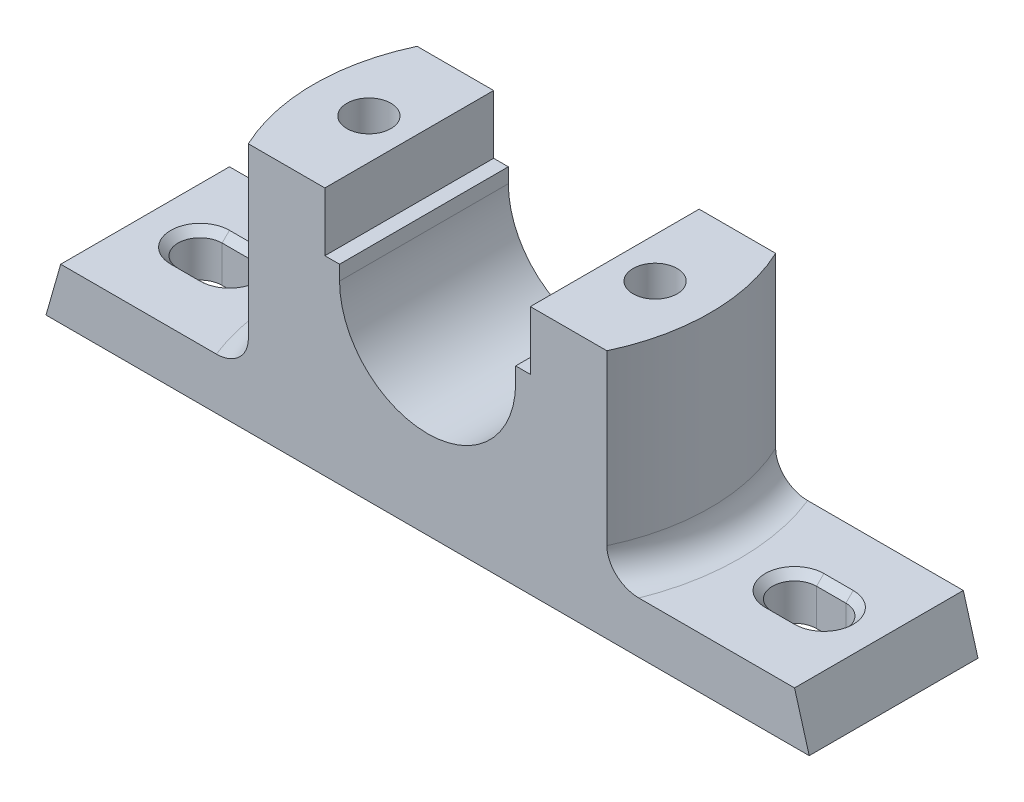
ISO-10303-21;
HEADER;
FILE_DESCRIPTION(('STEP AP214'),'2;1');
FILE_NAME('part.step','',(''),(''),'','','');
FILE_SCHEMA(('AUTOMOTIVE_DESIGN { 1 0 10303 214 1 1 1 1 }'));
ENDSEC;
DATA;
#1=APPLICATION_CONTEXT('core data for automotive mechanical design processes');
#2=APPLICATION_PROTOCOL_DEFINITION('international standard','automotive_design',2000,#1);
#3=PRODUCT_CONTEXT('',#1,'mechanical');
#4=PRODUCT('Part','Part','',(#3));
#5=PRODUCT_RELATED_PRODUCT_CATEGORY('part','',(#4));
#6=PRODUCT_DEFINITION_FORMATION('','',#4);
#7=PRODUCT_DEFINITION_CONTEXT('part definition',#1,'design');
#8=PRODUCT_DEFINITION('design','',#6,#7);
#9=PRODUCT_DEFINITION_SHAPE('','',#8);
#10=(LENGTH_UNIT() NAMED_UNIT(*) SI_UNIT(.MILLI.,.METRE.));
#11=(NAMED_UNIT(*) PLANE_ANGLE_UNIT() SI_UNIT($,.RADIAN.));
#12=(NAMED_UNIT(*) SI_UNIT($,.STERADIAN.) SOLID_ANGLE_UNIT());
#13=UNCERTAINTY_MEASURE_WITH_UNIT(LENGTH_MEASURE(1.E-05),#10,'distance_accuracy_value','');
#14=(GEOMETRIC_REPRESENTATION_CONTEXT(3) GLOBAL_UNCERTAINTY_ASSIGNED_CONTEXT((#13)) GLOBAL_UNIT_ASSIGNED_CONTEXT((#10,
#11,#12)) REPRESENTATION_CONTEXT('',''));
#15=CARTESIAN_POINT('',(0.,0.,0.));
#16=DIRECTION('',(0.,0.,1.));
#17=DIRECTION('',(1.,0.,0.));
#18=AXIS2_PLACEMENT_3D('',#15,#16,#17);
#19=CARTESIAN_POINT('',(54.,68.,23.));
#20=DIRECTION('',(0.,-1.,0.));
#21=DIRECTION('',(0.,0.,-1.));
#22=AXIS2_PLACEMENT_3D('',#19,#20,#21);
#23=PLANE('',#22);
#24=CARTESIAN_POINT('',(39.,68.,0.));
#25=DIRECTION('',(0.,1.,0.));
#26=DIRECTION('',(0.,0.,1.));
#27=AXIS2_PLACEMENT_3D('',#24,#25,#26);
#28=CIRCLE('',#27,5.99999999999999);
#29=CARTESIAN_POINT('',(39.,68.,5.99999999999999));
#30=VERTEX_POINT('',#29);
#31=EDGE_CURVE('E410',#30,#30,#28,.T.);
#32=ORIENTED_EDGE('',*,*,#31,.F.);
#33=EDGE_LOOP('',(#32));
#34=FACE_BOUND('',#33,.T.);
#35=CARTESIAN_POINT('',(0.,68.,0.));
#36=DIRECTION('',(0.,1.,0.));
#37=DIRECTION('',(1.,0.,0.));
#38=AXIS2_PLACEMENT_3D('',#35,#36,#37);
#39=CIRCLE('',#38,54.);
#40=CARTESIAN_POINT('',(48.8569340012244,68.,23.));
#41=VERTEX_POINT('',#40);
#42=CARTESIAN_POINT('',(48.8569340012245,68.,-23.));
#43=VERTEX_POINT('',#42);
#44=EDGE_CURVE('E529',#41,#43,#39,.T.);
#45=ORIENTED_EDGE('',*,*,#44,.T.);
#46=DIRECTION('',(-1.,0.,0.));
#47=VECTOR('',#46,1.);
#48=CARTESIAN_POINT('',(54.,68.,-23.));
#49=LINE('',#48,#47);
#50=CARTESIAN_POINT('',(28.,68.,-23.));
#51=VERTEX_POINT('',#50);
#52=EDGE_CURVE('E580',#43,#51,#49,.T.);
#53=ORIENTED_EDGE('',*,*,#52,.T.);
#54=DIRECTION('',(0.,0.,-1.));
#55=VECTOR('',#54,1.);
#56=CARTESIAN_POINT('',(28.,68.,23.));
#57=LINE('',#56,#55);
#58=CARTESIAN_POINT('',(28.,68.,23.));
#59=VERTEX_POINT('',#58);
#60=EDGE_CURVE('E623',#59,#51,#57,.T.);
#61=ORIENTED_EDGE('',*,*,#60,.F.);
#62=DIRECTION('',(-1.,0.,0.));
#63=VECTOR('',#62,1.);
#64=CARTESIAN_POINT('',(54.,68.,23.));
#65=LINE('',#64,#63);
#66=EDGE_CURVE('E549',#41,#59,#65,.T.);
#67=ORIENTED_EDGE('',*,*,#66,.F.);
#68=EDGE_LOOP('',(#45,#53,#61,#67));
#69=FACE_BOUND('',#68,.T.);
#70=ADVANCED_FACE('F32',(#34,#69),#23,.F.);
#71=CARTESIAN_POINT('',(-54.,68.,23.));
#72=DIRECTION('',(0.,-1.,0.));
#73=DIRECTION('',(1.,0.,0.));
#74=AXIS2_PLACEMENT_3D('',#71,#72,#73);
#75=PLANE('',#74);
#76=CARTESIAN_POINT('',(-39.,68.,0.));
#77=DIRECTION('',(0.,1.,0.));
#78=DIRECTION('',(-1.,0.,0.));
#79=AXIS2_PLACEMENT_3D('',#76,#77,#78);
#80=CIRCLE('',#79,5.99999999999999);
#81=CARTESIAN_POINT('',(-45.,68.,0.));
#82=VERTEX_POINT('',#81);
#83=EDGE_CURVE('E423',#82,#82,#80,.T.);
#84=ORIENTED_EDGE('',*,*,#83,.F.);
#85=EDGE_LOOP('',(#84));
#86=FACE_BOUND('',#85,.T.);
#87=CARTESIAN_POINT('',(0.,68.,0.));
#88=DIRECTION('',(0.,1.,0.));
#89=DIRECTION('',(-1.,0.,0.));
#90=AXIS2_PLACEMENT_3D('',#87,#88,#89);
#91=CIRCLE('',#90,54.);
#92=CARTESIAN_POINT('',(-48.8569340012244,68.,-23.));
#93=VERTEX_POINT('',#92);
#94=CARTESIAN_POINT('',(-48.8569340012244,68.,23.));
#95=VERTEX_POINT('',#94);
#96=EDGE_CURVE('E524',#93,#95,#91,.T.);
#97=ORIENTED_EDGE('',*,*,#96,.T.);
#98=DIRECTION('',(-1.,0.,0.));
#99=VECTOR('',#98,1.);
#100=CARTESIAN_POINT('',(-54.,68.,23.));
#101=LINE('',#100,#99);
#102=CARTESIAN_POINT('',(-28.,68.,23.));
#103=VERTEX_POINT('',#102);
#104=EDGE_CURVE('E565',#103,#95,#101,.T.);
#105=ORIENTED_EDGE('',*,*,#104,.F.);
#106=DIRECTION('',(0.,0.,-1.));
#107=VECTOR('',#106,1.);
#108=CARTESIAN_POINT('',(-28.,68.,23.));
#109=LINE('',#108,#107);
#110=CARTESIAN_POINT('',(-28.,68.,-23.));
#111=VERTEX_POINT('',#110);
#112=EDGE_CURVE('E602',#103,#111,#109,.T.);
#113=ORIENTED_EDGE('',*,*,#112,.T.);
#114=DIRECTION('',(-1.,0.,0.));
#115=VECTOR('',#114,1.);
#116=CARTESIAN_POINT('',(-54.,68.,-23.));
#117=LINE('',#116,#115);
#118=EDGE_CURVE('E596',#111,#93,#117,.T.);
#119=ORIENTED_EDGE('',*,*,#118,.T.);
#120=EDGE_LOOP('',(#97,#105,#113,#119));
#121=FACE_BOUND('',#120,.T.);
#122=ADVANCED_FACE('F719',(#86,#121),#75,.F.);
#123=CARTESIAN_POINT('',(-104.,0.,23.));
#124=DIRECTION('',(0.961523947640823,-0.274721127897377,0.));
#125=DIRECTION('',(0.274721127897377,0.961523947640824,0.));
#126=AXIS2_PLACEMENT_3D('',#123,#124,#125);
#127=PLANE('',#126);
#128=DIRECTION('',(-0.274721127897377,-0.961523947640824,0.));
#129=VECTOR('',#128,1.);
#130=CARTESIAN_POINT('',(-104.,0.,-23.));
#131=LINE('',#130,#129);
#132=CARTESIAN_POINT('',(-100.,14.,-23.));
#133=VERTEX_POINT('',#132);
#134=CARTESIAN_POINT('',(-104.,0.,-23.));
#135=VERTEX_POINT('',#134);
#136=EDGE_CURVE('E537',#133,#135,#131,.T.);
#137=ORIENTED_EDGE('',*,*,#136,.T.);
#138=DIRECTION('',(0.,0.,-1.));
#139=VECTOR('',#138,1.);
#140=CARTESIAN_POINT('',(-104.,0.,23.));
#141=LINE('',#140,#139);
#142=CARTESIAN_POINT('',(-104.,0.,23.));
#143=VERTEX_POINT('',#142);
#144=EDGE_CURVE('E632',#143,#135,#141,.T.);
#145=ORIENTED_EDGE('',*,*,#144,.F.);
#146=DIRECTION('',(-0.274721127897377,-0.961523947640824,0.));
#147=VECTOR('',#146,1.);
#148=CARTESIAN_POINT('',(-104.,0.,23.));
#149=LINE('',#148,#147);
#150=CARTESIAN_POINT('',(-100.,14.,23.));
#151=VERTEX_POINT('',#150);
#152=EDGE_CURVE('E538',#151,#143,#149,.T.);
#153=ORIENTED_EDGE('',*,*,#152,.F.);
#154=DIRECTION('',(0.,0.,-1.));
#155=VECTOR('',#154,1.);
#156=CARTESIAN_POINT('',(-100.,14.,23.));
#157=LINE('',#156,#155);
#158=EDGE_CURVE('E570',#151,#133,#157,.T.);
#159=ORIENTED_EDGE('',*,*,#158,.T.);
#160=EDGE_LOOP('',(#137,#145,#153,#159));
#161=FACE_BOUND('',#160,.T.);
#162=ADVANCED_FACE('F725',(#161),#127,.F.);
#163=CARTESIAN_POINT('',(-104.,0.,23.));
#164=DIRECTION('',(0.,1.,0.));
#165=DIRECTION('',(-1.,0.,0.));
#166=AXIS2_PLACEMENT_3D('',#163,#164,#165);
#167=PLANE('',#166);
#168=DIRECTION('',(-1.,0.,0.));
#169=VECTOR('',#168,1.);
#170=CARTESIAN_POINT('',(-97.5,0.,17.5));
#171=LINE('',#170,#169);
#172=CARTESIAN_POINT('',(97.4999999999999,0.,17.5));
#173=VERTEX_POINT('',#172);
#174=CARTESIAN_POINT('',(-97.5,0.,17.5));
#175=VERTEX_POINT('',#174);
#176=EDGE_CURVE('E507',#173,#175,#171,.T.);
#177=ORIENTED_EDGE('',*,*,#176,.F.);
#178=DIRECTION('',(0.,0.,1.));
#179=VECTOR('',#178,1.);
#180=CARTESIAN_POINT('',(97.5,0.,-17.5));
#181=LINE('',#180,#179);
#182=CARTESIAN_POINT('',(97.5,0.,-17.5));
#183=VERTEX_POINT('',#182);
#184=EDGE_CURVE('E485',#183,#173,#181,.T.);
#185=ORIENTED_EDGE('',*,*,#184,.F.);
#186=DIRECTION('',(1.,0.,0.));
#187=VECTOR('',#186,1.);
#188=CARTESIAN_POINT('',(-97.5,0.,-17.5));
#189=LINE('',#188,#187);
#190=CARTESIAN_POINT('',(-97.5,0.,-17.5));
#191=VERTEX_POINT('',#190);
#192=EDGE_CURVE('E496',#191,#183,#189,.T.);
#193=ORIENTED_EDGE('',*,*,#192,.F.);
#194=DIRECTION('',(0.,0.,-1.));
#195=VECTOR('',#194,1.);
#196=CARTESIAN_POINT('',(-97.5,0.,-17.5));
#197=LINE('',#196,#195);
#198=EDGE_CURVE('E510',#175,#191,#197,.T.);
#199=ORIENTED_EDGE('',*,*,#198,.F.);
#200=EDGE_LOOP('',(#177,#185,#193,#199));
#201=FACE_BOUND('',#200,.T.);
#202=DIRECTION('',(1.,0.,0.));
#203=VECTOR('',#202,1.);
#204=CARTESIAN_POINT('',(-104.,0.,-23.));
#205=LINE('',#204,#203);
#206=CARTESIAN_POINT('',(104.,0.,-23.));
#207=VERTEX_POINT('',#206);
#208=EDGE_CURVE('E573',#135,#207,#205,.T.);
#209=ORIENTED_EDGE('',*,*,#208,.T.);
#210=DIRECTION('',(0.,0.,-1.));
#211=VECTOR('',#210,1.);
#212=CARTESIAN_POINT('',(104.,0.,23.));
#213=LINE('',#212,#211);
#214=CARTESIAN_POINT('',(104.,0.,23.));
#215=VERTEX_POINT('',#214);
#216=EDGE_CURVE('E629',#215,#207,#213,.T.);
#217=ORIENTED_EDGE('',*,*,#216,.F.);
#218=DIRECTION('',(1.,0.,0.));
#219=VECTOR('',#218,1.);
#220=CARTESIAN_POINT('',(-104.,0.,23.));
#221=LINE('',#220,#219);
#222=EDGE_CURVE('E541',#143,#215,#221,.T.);
#223=ORIENTED_EDGE('',*,*,#222,.F.);
#224=ORIENTED_EDGE('',*,*,#144,.T.);
#225=EDGE_LOOP('',(#209,#217,#223,#224));
#226=FACE_BOUND('',#225,.T.);
#227=ADVANCED_FACE('F741',(#201,#226),#167,.F.);
#228=CARTESIAN_POINT('',(104.,0.,23.));
#229=DIRECTION('',(-0.961523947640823,-0.274721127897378,0.));
#230=DIRECTION('',(0.274721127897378,-0.961523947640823,0.));
#231=AXIS2_PLACEMENT_3D('',#228,#229,#230);
#232=PLANE('',#231);
#233=DIRECTION('',(-0.274721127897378,0.961523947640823,0.));
#234=VECTOR('',#233,1.);
#235=CARTESIAN_POINT('',(104.,0.,-23.));
#236=LINE('',#235,#234);
#237=CARTESIAN_POINT('',(100.,14.,-23.));
#238=VERTEX_POINT('',#237);
#239=EDGE_CURVE('E575',#207,#238,#236,.T.);
#240=ORIENTED_EDGE('',*,*,#239,.T.);
#241=DIRECTION('',(0.,0.,-1.));
#242=VECTOR('',#241,1.);
#243=CARTESIAN_POINT('',(100.,14.,23.));
#244=LINE('',#243,#242);
#245=CARTESIAN_POINT('',(100.,14.,23.));
#246=VERTEX_POINT('',#245);
#247=EDGE_CURVE('E626',#246,#238,#244,.T.);
#248=ORIENTED_EDGE('',*,*,#247,.F.);
#249=DIRECTION('',(-0.274721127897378,0.961523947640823,0.));
#250=VECTOR('',#249,1.);
#251=CARTESIAN_POINT('',(104.,0.,23.));
#252=LINE('',#251,#250);
#253=EDGE_CURVE('E544',#215,#246,#252,.T.);
#254=ORIENTED_EDGE('',*,*,#253,.F.);
#255=ORIENTED_EDGE('',*,*,#216,.T.);
#256=EDGE_LOOP('',(#240,#248,#254,#255));
#257=FACE_BOUND('',#256,.T.);
#258=ADVANCED_FACE('F737',(#257),#232,.F.);
#259=CARTESIAN_POINT('',(100.,14.,23.));
#260=DIRECTION('',(0.,-1.,0.));
#261=DIRECTION('',(1.,0.,0.));
#262=AXIS2_PLACEMENT_3D('',#259,#260,#261);
#263=PLANE('',#262);
#264=CARTESIAN_POINT('',(85.,14.,0.));
#265=DIRECTION('',(0.,-1.,0.));
#266=DIRECTION('',(1.,0.,0.));
#267=AXIS2_PLACEMENT_3D('',#264,#265,#266);
#268=CIRCLE('',#267,8.00000000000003);
#269=CARTESIAN_POINT('',(85.,14.,-8.00000000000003));
#270=VERTEX_POINT('',#269);
#271=CARTESIAN_POINT('',(85.,14.,8.00000000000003));
#272=VERTEX_POINT('',#271);
#273=EDGE_CURVE('E341',#270,#272,#268,.T.);
#274=ORIENTED_EDGE('',*,*,#273,.T.);
#275=DIRECTION('',(-1.,0.,0.));
#276=VECTOR('',#275,1.);
#277=CARTESIAN_POINT('',(100.,14.,8.00000000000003));
#278=LINE('',#277,#276);
#279=CARTESIAN_POINT('',(77.,14.,8.00000000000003));
#280=VERTEX_POINT('',#279);
#281=EDGE_CURVE('E343',#272,#280,#278,.T.);
#282=ORIENTED_EDGE('',*,*,#281,.T.);
#283=CARTESIAN_POINT('',(77.,14.,0.));
#284=DIRECTION('',(0.,-1.,0.));
#285=DIRECTION('',(1.,0.,0.));
#286=AXIS2_PLACEMENT_3D('',#283,#284,#285);
#287=CIRCLE('',#286,8.00000000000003);
#288=CARTESIAN_POINT('',(77.,14.,-8.00000000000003));
#289=VERTEX_POINT('',#288);
#290=EDGE_CURVE('E339',#280,#289,#287,.T.);
#291=ORIENTED_EDGE('',*,*,#290,.T.);
#292=DIRECTION('',(1.,0.,0.));
#293=VECTOR('',#292,1.);
#294=CARTESIAN_POINT('',(100.,14.,-8.00000000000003));
#295=LINE('',#294,#293);
#296=EDGE_CURVE('E333',#289,#270,#295,.T.);
#297=ORIENTED_EDGE('',*,*,#296,.T.);
#298=EDGE_LOOP('',(#274,#282,#291,#297));
#299=FACE_BOUND('',#298,.T.);
#300=DIRECTION('',(-1.,0.,0.));
#301=VECTOR('',#300,1.);
#302=CARTESIAN_POINT('',(100.,14.,-23.));
#303=LINE('',#302,#301);
#304=CARTESIAN_POINT('',(57.5760366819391,14.,-23.));
#305=VERTEX_POINT('',#304);
#306=EDGE_CURVE('E577',#238,#305,#303,.T.);
#307=ORIENTED_EDGE('',*,*,#306,.T.);
#308=CARTESIAN_POINT('',(0.,14.,0.));
#309=DIRECTION('',(0.,-1.,0.));
#310=DIRECTION('',(1.,0.,0.));
#311=AXIS2_PLACEMENT_3D('',#308,#309,#310);
#312=CIRCLE('',#311,62.);
#313=CARTESIAN_POINT('',(57.5760366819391,14.,23.));
#314=VERTEX_POINT('',#313);
#315=EDGE_CURVE('E647',#305,#314,#312,.T.);
#316=ORIENTED_EDGE('',*,*,#315,.T.);
#317=DIRECTION('',(-1.,0.,0.));
#318=VECTOR('',#317,1.);
#319=CARTESIAN_POINT('',(100.,14.,23.));
#320=LINE('',#319,#318);
#321=EDGE_CURVE('E546',#246,#314,#320,.T.);
#322=ORIENTED_EDGE('',*,*,#321,.F.);
#323=ORIENTED_EDGE('',*,*,#247,.T.);
#324=EDGE_LOOP('',(#307,#316,#322,#323));
#325=FACE_BOUND('',#324,.T.);
#326=ADVANCED_FACE('F734',(#299,#325),#263,.F.);
#327=CARTESIAN_POINT('',(28.,68.,23.));
#328=DIRECTION('',(1.,0.,0.));
#329=DIRECTION('',(0.,1.,0.));
#330=AXIS2_PLACEMENT_3D('',#327,#328,#329);
#331=PLANE('',#330);
#332=DIRECTION('',(0.,-1.,0.));
#333=VECTOR('',#332,1.);
#334=CARTESIAN_POINT('',(28.,68.,-23.));
#335=LINE('',#334,#333);
#336=CARTESIAN_POINT('',(28.,52.,-23.));
#337=VERTEX_POINT('',#336);
#338=EDGE_CURVE('E582',#51,#337,#335,.T.);
#339=ORIENTED_EDGE('',*,*,#338,.T.);
#340=DIRECTION('',(0.,0.,-1.));
#341=VECTOR('',#340,1.);
#342=CARTESIAN_POINT('',(28.,52.,23.));
#343=LINE('',#342,#341);
#344=CARTESIAN_POINT('',(28.,52.,23.));
#345=VERTEX_POINT('',#344);
#346=EDGE_CURVE('E620',#345,#337,#343,.T.);
#347=ORIENTED_EDGE('',*,*,#346,.F.);
#348=DIRECTION('',(0.,-1.,0.));
#349=VECTOR('',#348,1.);
#350=CARTESIAN_POINT('',(28.,68.,23.));
#351=LINE('',#350,#349);
#352=EDGE_CURVE('E551',#59,#345,#351,.T.);
#353=ORIENTED_EDGE('',*,*,#352,.F.);
#354=ORIENTED_EDGE('',*,*,#60,.T.);
#355=EDGE_LOOP('',(#339,#347,#353,#354));
#356=FACE_BOUND('',#355,.T.);
#357=ADVANCED_FACE('F732',(#356),#331,.F.);
#358=CARTESIAN_POINT('',(28.,52.,23.));
#359=DIRECTION('',(0.,-1.,0.));
#360=DIRECTION('',(1.,0.,0.));
#361=AXIS2_PLACEMENT_3D('',#358,#359,#360);
#362=PLANE('',#361);
#363=DIRECTION('',(-1.,0.,0.));
#364=VECTOR('',#363,1.);
#365=CARTESIAN_POINT('',(28.,52.,-23.));
#366=LINE('',#365,#364);
#367=CARTESIAN_POINT('',(24.,52.,-23.));
#368=VERTEX_POINT('',#367);
#369=EDGE_CURVE('E584',#337,#368,#366,.T.);
#370=ORIENTED_EDGE('',*,*,#369,.T.);
#371=DIRECTION('',(0.,0.,-1.));
#372=VECTOR('',#371,1.);
#373=CARTESIAN_POINT('',(24.,52.,23.));
#374=LINE('',#373,#372);
#375=CARTESIAN_POINT('',(24.,52.,23.));
#376=VERTEX_POINT('',#375);
#377=EDGE_CURVE('E617',#376,#368,#374,.T.);
#378=ORIENTED_EDGE('',*,*,#377,.F.);
#379=DIRECTION('',(-1.,0.,0.));
#380=VECTOR('',#379,1.);
#381=CARTESIAN_POINT('',(28.,52.,23.));
#382=LINE('',#381,#380);
#383=EDGE_CURVE('E553',#345,#376,#382,.T.);
#384=ORIENTED_EDGE('',*,*,#383,.F.);
#385=ORIENTED_EDGE('',*,*,#346,.T.);
#386=EDGE_LOOP('',(#370,#378,#384,#385));
#387=FACE_BOUND('',#386,.T.);
#388=ADVANCED_FACE('F788',(#387),#362,.F.);
#389=CARTESIAN_POINT('',(24.,52.,23.));
#390=DIRECTION('',(1.,0.,0.));
#391=DIRECTION('',(0.,1.,0.));
#392=AXIS2_PLACEMENT_3D('',#389,#390,#391);
#393=PLANE('',#392);
#394=DIRECTION('',(0.,-1.,0.));
#395=VECTOR('',#394,1.);
#396=CARTESIAN_POINT('',(24.,52.,-23.));
#397=LINE('',#396,#395);
#398=CARTESIAN_POINT('',(24.,48.,-23.));
#399=VERTEX_POINT('',#398);
#400=EDGE_CURVE('E586',#368,#399,#397,.T.);
#401=ORIENTED_EDGE('',*,*,#400,.T.);
#402=DIRECTION('',(0.,0.,-1.));
#403=VECTOR('',#402,1.);
#404=CARTESIAN_POINT('',(24.,48.,23.));
#405=LINE('',#404,#403);
#406=CARTESIAN_POINT('',(24.,48.,23.));
#407=VERTEX_POINT('',#406);
#408=EDGE_CURVE('E614',#407,#399,#405,.T.);
#409=ORIENTED_EDGE('',*,*,#408,.F.);
#410=DIRECTION('',(0.,-1.,0.));
#411=VECTOR('',#410,1.);
#412=CARTESIAN_POINT('',(24.,52.,23.));
#413=LINE('',#412,#411);
#414=EDGE_CURVE('E555',#376,#407,#413,.T.);
#415=ORIENTED_EDGE('',*,*,#414,.F.);
#416=ORIENTED_EDGE('',*,*,#377,.T.);
#417=EDGE_LOOP('',(#401,#409,#415,#416));
#418=FACE_BOUND('',#417,.T.);
#419=ADVANCED_FACE('F793',(#418),#393,.F.);
#420=CARTESIAN_POINT('',(0.,48.,23.));
#421=DIRECTION('',(0.,0.,-1.));
#422=DIRECTION('',(-1.,0.,0.));
#423=AXIS2_PLACEMENT_3D('',#420,#421,#422);
#424=CYLINDRICAL_SURFACE('',#423,24.);
#425=CARTESIAN_POINT('',(0.,48.,-23.));
#426=DIRECTION('',(0.,0.,-1.));
#427=DIRECTION('',(1.,0.,0.));
#428=AXIS2_PLACEMENT_3D('',#425,#426,#427);
#429=CIRCLE('',#428,24.);
#430=CARTESIAN_POINT('',(-24.,48.,-23.));
#431=VERTEX_POINT('',#430);
#432=EDGE_CURVE('E588',#399,#431,#429,.T.);
#433=ORIENTED_EDGE('',*,*,#432,.T.);
#434=DIRECTION('',(0.,0.,-1.));
#435=VECTOR('',#434,1.);
#436=CARTESIAN_POINT('',(-24.,48.,23.));
#437=LINE('',#436,#435);
#438=CARTESIAN_POINT('',(-24.,48.,23.));
#439=VERTEX_POINT('',#438);
#440=EDGE_CURVE('E611',#439,#431,#437,.T.);
#441=ORIENTED_EDGE('',*,*,#440,.F.);
#442=CARTESIAN_POINT('',(0.,48.,23.));
#443=DIRECTION('',(0.,0.,-1.));
#444=DIRECTION('',(1.,0.,0.));
#445=AXIS2_PLACEMENT_3D('',#442,#443,#444);
#446=CIRCLE('',#445,24.);
#447=EDGE_CURVE('E557',#407,#439,#446,.T.);
#448=ORIENTED_EDGE('',*,*,#447,.F.);
#449=ORIENTED_EDGE('',*,*,#408,.T.);
#450=EDGE_LOOP('',(#433,#441,#448,#449));
#451=FACE_BOUND('',#450,.T.);
#452=ADVANCED_FACE('F799',(#451),#424,.F.);
#453=CARTESIAN_POINT('',(-24.,52.,23.));
#454=DIRECTION('',(-1.,0.,0.));
#455=DIRECTION('',(0.,-1.,0.));
#456=AXIS2_PLACEMENT_3D('',#453,#454,#455);
#457=PLANE('',#456);
#458=DIRECTION('',(0.,1.,0.));
#459=VECTOR('',#458,1.);
#460=CARTESIAN_POINT('',(-24.,52.,-23.));
#461=LINE('',#460,#459);
#462=CARTESIAN_POINT('',(-24.,52.,-23.));
#463=VERTEX_POINT('',#462);
#464=EDGE_CURVE('E590',#431,#463,#461,.T.);
#465=ORIENTED_EDGE('',*,*,#464,.T.);
#466=DIRECTION('',(0.,0.,-1.));
#467=VECTOR('',#466,1.);
#468=CARTESIAN_POINT('',(-24.,52.,23.));
#469=LINE('',#468,#467);
#470=CARTESIAN_POINT('',(-24.,52.,23.));
#471=VERTEX_POINT('',#470);
#472=EDGE_CURVE('E608',#471,#463,#469,.T.);
#473=ORIENTED_EDGE('',*,*,#472,.F.);
#474=DIRECTION('',(0.,1.,0.));
#475=VECTOR('',#474,1.);
#476=CARTESIAN_POINT('',(-24.,52.,23.));
#477=LINE('',#476,#475);
#478=EDGE_CURVE('E559',#439,#471,#477,.T.);
#479=ORIENTED_EDGE('',*,*,#478,.F.);
#480=ORIENTED_EDGE('',*,*,#440,.T.);
#481=EDGE_LOOP('',(#465,#473,#479,#480));
#482=FACE_BOUND('',#481,.T.);
#483=ADVANCED_FACE('F803',(#482),#457,.F.);
#484=CARTESIAN_POINT('',(-28.,52.,23.));
#485=DIRECTION('',(0.,-1.,0.));
#486=DIRECTION('',(1.,0.,0.));
#487=AXIS2_PLACEMENT_3D('',#484,#485,#486);
#488=PLANE('',#487);
#489=DIRECTION('',(-1.,0.,0.));
#490=VECTOR('',#489,1.);
#491=CARTESIAN_POINT('',(-28.,52.,-23.));
#492=LINE('',#491,#490);
#493=CARTESIAN_POINT('',(-28.,52.,-23.));
#494=VERTEX_POINT('',#493);
#495=EDGE_CURVE('E592',#463,#494,#492,.T.);
#496=ORIENTED_EDGE('',*,*,#495,.T.);
#497=DIRECTION('',(0.,0.,-1.));
#498=VECTOR('',#497,1.);
#499=CARTESIAN_POINT('',(-28.,52.,23.));
#500=LINE('',#499,#498);
#501=CARTESIAN_POINT('',(-28.,52.,23.));
#502=VERTEX_POINT('',#501);
#503=EDGE_CURVE('E605',#502,#494,#500,.T.);
#504=ORIENTED_EDGE('',*,*,#503,.F.);
#505=DIRECTION('',(-1.,0.,0.));
#506=VECTOR('',#505,1.);
#507=CARTESIAN_POINT('',(-28.,52.,23.));
#508=LINE('',#507,#506);
#509=EDGE_CURVE('E561',#471,#502,#508,.T.);
#510=ORIENTED_EDGE('',*,*,#509,.F.);
#511=ORIENTED_EDGE('',*,*,#472,.T.);
#512=EDGE_LOOP('',(#496,#504,#510,#511));
#513=FACE_BOUND('',#512,.T.);
#514=ADVANCED_FACE('F808',(#513),#488,.F.);
#515=CARTESIAN_POINT('',(-28.,68.,23.));
#516=DIRECTION('',(-1.,0.,0.));
#517=DIRECTION('',(0.,-1.,0.));
#518=AXIS2_PLACEMENT_3D('',#515,#516,#517);
#519=PLANE('',#518);
#520=DIRECTION('',(0.,1.,0.));
#521=VECTOR('',#520,1.);
#522=CARTESIAN_POINT('',(-28.,68.,-23.));
#523=LINE('',#522,#521);
#524=EDGE_CURVE('E594',#494,#111,#523,.T.);
#525=ORIENTED_EDGE('',*,*,#524,.T.);
#526=ORIENTED_EDGE('',*,*,#112,.F.);
#527=DIRECTION('',(0.,1.,0.));
#528=VECTOR('',#527,1.);
#529=CARTESIAN_POINT('',(-28.,68.,23.));
#530=LINE('',#529,#528);
#531=EDGE_CURVE('E563',#502,#103,#530,.T.);
#532=ORIENTED_EDGE('',*,*,#531,.F.);
#533=ORIENTED_EDGE('',*,*,#503,.T.);
#534=EDGE_LOOP('',(#525,#526,#532,#533));
#535=FACE_BOUND('',#534,.T.);
#536=ADVANCED_FACE('F813',(#535),#519,.F.);
#537=CARTESIAN_POINT('',(-100.,14.,23.));
#538=DIRECTION('',(0.,-1.,0.));
#539=DIRECTION('',(0.,0.,-1.));
#540=AXIS2_PLACEMENT_3D('',#537,#538,#539);
#541=PLANE('',#540);
#542=CARTESIAN_POINT('',(-77.,14.,0.));
#543=DIRECTION('',(0.,-1.,0.));
#544=DIRECTION('',(0.,0.,-1.));
#545=AXIS2_PLACEMENT_3D('',#542,#543,#544);
#546=CIRCLE('',#545,8.00000000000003);
#547=CARTESIAN_POINT('',(-77.,14.,-8.00000000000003));
#548=VERTEX_POINT('',#547);
#549=CARTESIAN_POINT('',(-77.,14.,8.00000000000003));
#550=VERTEX_POINT('',#549);
#551=EDGE_CURVE('E358',#548,#550,#546,.T.);
#552=ORIENTED_EDGE('',*,*,#551,.T.);
#553=DIRECTION('',(-1.,0.,0.));
#554=VECTOR('',#553,1.);
#555=CARTESIAN_POINT('',(-100.,14.,8.00000000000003));
#556=LINE('',#555,#554);
#557=CARTESIAN_POINT('',(-85.,14.,8.00000000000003));
#558=VERTEX_POINT('',#557);
#559=EDGE_CURVE('E360',#550,#558,#556,.T.);
#560=ORIENTED_EDGE('',*,*,#559,.T.);
#561=CARTESIAN_POINT('',(-85.,14.,0.));
#562=DIRECTION('',(0.,-1.,0.));
#563=DIRECTION('',(0.,0.,-1.));
#564=AXIS2_PLACEMENT_3D('',#561,#562,#563);
#565=CIRCLE('',#564,8.00000000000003);
#566=CARTESIAN_POINT('',(-85.,14.,-8.00000000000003));
#567=VERTEX_POINT('',#566);
#568=EDGE_CURVE('E356',#558,#567,#565,.T.);
#569=ORIENTED_EDGE('',*,*,#568,.T.);
#570=DIRECTION('',(1.,0.,0.));
#571=VECTOR('',#570,1.);
#572=CARTESIAN_POINT('',(-100.,14.,-8.00000000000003));
#573=LINE('',#572,#571);
#574=EDGE_CURVE('E354',#567,#548,#573,.T.);
#575=ORIENTED_EDGE('',*,*,#574,.T.);
#576=EDGE_LOOP('',(#552,#560,#569,#575));
#577=FACE_BOUND('',#576,.T.);
#578=DIRECTION('',(-1.,0.,0.));
#579=VECTOR('',#578,1.);
#580=CARTESIAN_POINT('',(-100.,14.,23.));
#581=LINE('',#580,#579);
#582=CARTESIAN_POINT('',(-57.5760366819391,14.,23.));
#583=VERTEX_POINT('',#582);
#584=EDGE_CURVE('E568',#583,#151,#581,.T.);
#585=ORIENTED_EDGE('',*,*,#584,.F.);
#586=CARTESIAN_POINT('',(0.,14.,0.));
#587=DIRECTION('',(0.,-1.,0.));
#588=DIRECTION('',(0.,0.,-1.));
#589=AXIS2_PLACEMENT_3D('',#586,#587,#588);
#590=CIRCLE('',#589,62.);
#591=CARTESIAN_POINT('',(-57.5760366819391,14.,-23.));
#592=VERTEX_POINT('',#591);
#593=EDGE_CURVE('E642',#583,#592,#590,.T.);
#594=ORIENTED_EDGE('',*,*,#593,.T.);
#595=DIRECTION('',(-1.,0.,0.));
#596=VECTOR('',#595,1.);
#597=CARTESIAN_POINT('',(-100.,14.,-23.));
#598=LINE('',#597,#596);
#599=EDGE_CURVE('E542',#592,#133,#598,.T.);
#600=ORIENTED_EDGE('',*,*,#599,.T.);
#601=ORIENTED_EDGE('',*,*,#158,.F.);
#602=EDGE_LOOP('',(#585,#594,#600,#601));
#603=FACE_BOUND('',#602,.T.);
#604=ADVANCED_FACE('F392',(#577,#603),#541,.F.);
#605=CARTESIAN_POINT('',(0.,48.,23.));
#606=DIRECTION('',(0.,0.,1.));
#607=DIRECTION('',(1.,0.,0.));
#608=AXIS2_PLACEMENT_3D('',#605,#606,#607);
#609=PLANE('',#608);
#610=DIRECTION('',(0.,1.,0.));
#611=VECTOR('',#610,1.);
#612=CARTESIAN_POINT('',(-48.8569340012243,-204.022498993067,23.));
#613=LINE('',#612,#611);
#614=CARTESIAN_POINT('',(-48.8569340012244,22.,23.));
#615=VERTEX_POINT('',#614);
#616=EDGE_CURVE('E532',#615,#95,#613,.T.);
#617=ORIENTED_EDGE('',*,*,#616,.F.);
#618=CARTESIAN_POINT('',(-48.8569340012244,22.,23.));
#619=CARTESIAN_POINT('',(-48.8568944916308,21.7897037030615,23.));
#620=CARTESIAN_POINT('',(-48.8660972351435,21.5794200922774,23.));
#621=CARTESIAN_POINT('',(-48.9026955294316,21.1604976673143,23.));
#622=CARTESIAN_POINT('',(-48.9300861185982,20.9518584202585,23.));
#623=CARTESIAN_POINT('',(-49.0026422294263,20.5384483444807,23.));
#624=CARTESIAN_POINT('',(-49.0477455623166,20.333666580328,23.));
#625=CARTESIAN_POINT('',(-49.1551914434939,19.928676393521,23.));
#626=CARTESIAN_POINT('',(-49.2175345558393,19.7284681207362,23.));
#627=CARTESIAN_POINT('',(-49.3587056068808,19.3341515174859,23.));
#628=CARTESIAN_POINT('',(-49.4375194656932,19.1400381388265,23.));
#629=CARTESIAN_POINT('',(-49.6108643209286,18.7588835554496,23.));
#630=CARTESIAN_POINT('',(-49.7054011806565,18.5718450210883,23.));
#631=CARTESIAN_POINT('',(-49.9092601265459,18.2059678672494,23.));
#632=CARTESIAN_POINT('',(-50.0185851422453,18.0271308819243,23.));
#633=CARTESIAN_POINT('',(-50.251044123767,17.6785870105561,23.));
#634=CARTESIAN_POINT('',(-50.3741833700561,17.5088836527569,23.));
#635=CARTESIAN_POINT('',(-50.6386238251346,17.1726098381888,23.));
#636=CARTESIAN_POINT('',(-50.7804689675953,17.0064666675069,23.));
#637=CARTESIAN_POINT('',(-51.0768009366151,16.6858302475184,23.));
#638=CARTESIAN_POINT('',(-51.2312923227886,16.5313412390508,23.));
#639=CARTESIAN_POINT('',(-51.7119073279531,16.0864805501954,23.));
#640=CARTESIAN_POINT('',(-52.0553511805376,15.8144890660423,23.));
#641=CARTESIAN_POINT('',(-52.8107494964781,15.3025371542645,23.));
#642=CARTESIAN_POINT('',(-53.2260819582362,15.0675926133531,23.));
#643=CARTESIAN_POINT('',(-54.0883596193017,14.665281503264,23.));
#644=CARTESIAN_POINT('',(-54.5353157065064,14.497938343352,23.));
#645=CARTESIAN_POINT('',(-55.4119481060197,14.2445948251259,23.));
#646=CARTESIAN_POINT('',(-55.8400171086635,14.1530314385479,23.));
#647=CARTESIAN_POINT('',(-56.4880371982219,14.0613163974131,23.));
#648=CARTESIAN_POINT('',(-56.7049685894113,14.0383497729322,23.));
#649=CARTESIAN_POINT('',(-57.1399216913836,14.0076931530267,23.));
#650=CARTESIAN_POINT('',(-57.3579434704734,14.0000041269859,23.));
#651=CARTESIAN_POINT('',(-57.5760366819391,14.,23.));
#652=B_SPLINE_CURVE_WITH_KNOTS('',3,(#618,#619,#620,#621,#622,#623,#624,#625,#626,#627,#628,
#629,#630,#631,#632,#633,#634,#635,#636,#637,#638,#639,#640,#641,#642,#643,#644,#645,#646,#647,
#648,#649,#650,#651),.UNSPECIFIED.,.F.,.F.,(4,2,2,2,2,2,2,2,2,2,2,2,2,2,2,2,4),(0.,
0.630667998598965,1.26116402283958,1.8894659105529,2.51778835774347,3.14557586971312,
3.77359801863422,4.40174476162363,5.03013243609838,5.68478012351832,6.33966489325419,
7.64857785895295,9.07415774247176,10.500230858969,11.8088856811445,12.462847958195,
13.1168517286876),.UNSPECIFIED.);
#653=EDGE_CURVE('E649',#615,#583,#652,.T.);
#654=ORIENTED_EDGE('',*,*,#653,.T.);
#655=ORIENTED_EDGE('',*,*,#584,.T.);
#656=ORIENTED_EDGE('',*,*,#152,.T.);
#657=ORIENTED_EDGE('',*,*,#222,.T.);
#658=ORIENTED_EDGE('',*,*,#253,.T.);
#659=ORIENTED_EDGE('',*,*,#321,.T.);
#660=CARTESIAN_POINT('',(57.5760366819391,14.,23.));
#661=CARTESIAN_POINT('',(57.3157465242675,13.9999861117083,23.));
#662=CARTESIAN_POINT('',(57.0554642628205,14.0109545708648,23.));
#663=CARTESIAN_POINT('',(56.5367274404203,14.0546304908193,23.));
#664=CARTESIAN_POINT('',(56.2782728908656,14.0873380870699,23.));
#665=CARTESIAN_POINT('',(55.7647130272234,14.17431631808,23.));
#666=CARTESIAN_POINT('',(55.5096118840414,14.228611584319,23.));
#667=CARTESIAN_POINT('',(55.0048736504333,14.3584433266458,23.));
#668=CARTESIAN_POINT('',(54.755236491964,14.4339795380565,23.));
#669=CARTESIAN_POINT('',(54.2630898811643,14.605957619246,23.));
#670=CARTESIAN_POINT('',(54.0205849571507,14.7024124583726,23.));
#671=CARTESIAN_POINT('',(53.5446290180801,14.9157643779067,23.));
#672=CARTESIAN_POINT('',(53.3111812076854,15.0326686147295,23.));
#673=CARTESIAN_POINT('',(52.8554559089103,15.2862486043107,23.));
#674=CARTESIAN_POINT('',(52.6331717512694,15.4229123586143,23.));
#675=CARTESIAN_POINT('',(52.2015693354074,15.7153670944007,23.));
#676=CARTESIAN_POINT('',(51.9922500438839,15.8711565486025,23.));
#677=CARTESIAN_POINT('',(51.5944194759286,16.1962302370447,23.));
#678=CARTESIAN_POINT('',(51.4054800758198,16.3649902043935,23.));
#679=CARTESIAN_POINT('',(51.0436072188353,16.7187493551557,23.));
#680=CARTESIAN_POINT('',(50.8706666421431,16.9037412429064,23.));
#681=CARTESIAN_POINT('',(50.5425384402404,17.2889300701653,23.));
#682=CARTESIAN_POINT('',(50.3873540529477,17.4891297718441,23.));
#683=CARTESIAN_POINT('',(50.0966425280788,17.903321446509,23.));
#684=CARTESIAN_POINT('',(49.9611128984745,18.1173116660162,23.));
#685=CARTESIAN_POINT('',(49.7218092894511,18.5392382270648,23.));
#686=CARTESIAN_POINT('',(49.6163360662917,18.7462117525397,23.));
#687=CARTESIAN_POINT('',(49.4246955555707,19.1689008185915,23.));
#688=CARTESIAN_POINT('',(49.3385256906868,19.3846151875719,23.));
#689=CARTESIAN_POINT('',(49.186731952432,19.822743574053,23.));
#690=CARTESIAN_POINT('',(49.121072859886,20.0451453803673,23.));
#691=CARTESIAN_POINT('',(49.0110307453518,20.4950496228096,23.));
#692=CARTESIAN_POINT('',(48.9666359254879,20.7225491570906,23.));
#693=CARTESIAN_POINT('',(48.9078153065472,21.1252552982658,23.));
#694=CARTESIAN_POINT('',(48.8887373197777,21.2997960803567,23.));
#695=CARTESIAN_POINT('',(48.8632978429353,21.6495508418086,23.));
#696=CARTESIAN_POINT('',(48.8569182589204,21.8247635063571,23.));
#697=CARTESIAN_POINT('',(48.8569340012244,22.,23.));
#698=B_SPLINE_CURVE_WITH_KNOTS('',3,(#660,#661,#662,#663,#664,#665,#666,#667,#668,#669,#670,
#671,#672,#673,#674,#675,#676,#677,#678,#679,#680,#681,#682,#683,#684,#685,#686,#687,#688,#689,
#690,#691,#692,#693,#694,#695,#696,#697),.UNSPECIFIED.,.F.,.F.,(4,2,2,2,2,2,2,2,2,2,2,2,2,2,2,2,
2,2,4),(0.,0.780629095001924,1.56126305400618,2.34279028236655,3.12430777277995,3.9063111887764,
4.68858882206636,5.47039341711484,6.25213562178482,7.01114143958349,7.76980784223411,
8.52861237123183,9.28732060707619,9.98328546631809,10.6791573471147,11.3738276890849,
12.0681121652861,12.5944106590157,13.1199586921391),.UNSPECIFIED.);
#699=CARTESIAN_POINT('',(48.8569340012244,22.,23.));
#700=VERTEX_POINT('',#699);
#701=EDGE_CURVE('E678',#314,#700,#698,.T.);
#702=ORIENTED_EDGE('',*,*,#701,.T.);
#703=DIRECTION('',(0.,1.,0.));
#704=VECTOR('',#703,1.);
#705=CARTESIAN_POINT('',(48.8569340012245,-204.022498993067,23.));
#706=LINE('',#705,#704);
#707=EDGE_CURVE('E517',#700,#41,#706,.T.);
#708=ORIENTED_EDGE('',*,*,#707,.T.);
#709=ORIENTED_EDGE('',*,*,#66,.T.);
#710=ORIENTED_EDGE('',*,*,#352,.T.);
#711=ORIENTED_EDGE('',*,*,#383,.T.);
#712=ORIENTED_EDGE('',*,*,#414,.T.);
#713=ORIENTED_EDGE('',*,*,#447,.T.);
#714=ORIENTED_EDGE('',*,*,#478,.T.);
#715=ORIENTED_EDGE('',*,*,#509,.T.);
#716=ORIENTED_EDGE('',*,*,#531,.T.);
#717=ORIENTED_EDGE('',*,*,#104,.T.);
#718=EDGE_LOOP('',(#617,#654,#655,#656,#657,#658,#659,#702,#708,#709,#710,#711,#712,#713,#714,
#715,#716,#717));
#719=FACE_BOUND('',#718,.T.);
#720=ADVANCED_FACE('F666',(#719),#609,.T.);
#721=CARTESIAN_POINT('',(0.,48.,-23.));
#722=DIRECTION('',(0.,0.,1.));
#723=DIRECTION('',(1.,0.,0.));
#724=AXIS2_PLACEMENT_3D('',#721,#722,#723);
#725=PLANE('',#724);
#726=ORIENTED_EDGE('',*,*,#599,.F.);
#727=CARTESIAN_POINT('',(-57.5760366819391,14.,-23.));
#728=CARTESIAN_POINT('',(-57.3157465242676,13.9999861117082,-23.));
#729=CARTESIAN_POINT('',(-57.0554642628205,14.0109545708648,-23.));
#730=CARTESIAN_POINT('',(-56.5367274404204,14.0546304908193,-23.));
#731=CARTESIAN_POINT('',(-56.2782728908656,14.0873380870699,-23.));
#732=CARTESIAN_POINT('',(-55.7647130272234,14.17431631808,-23.));
#733=CARTESIAN_POINT('',(-55.5096118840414,14.228611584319,-23.));
#734=CARTESIAN_POINT('',(-55.0048736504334,14.3584433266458,-23.));
#735=CARTESIAN_POINT('',(-54.755236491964,14.4339795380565,-23.));
#736=CARTESIAN_POINT('',(-54.2630898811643,14.605957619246,-23.));
#737=CARTESIAN_POINT('',(-54.0205849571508,14.7024124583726,-23.));
#738=CARTESIAN_POINT('',(-53.5446290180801,14.9157643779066,-23.));
#739=CARTESIAN_POINT('',(-53.3111812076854,15.0326686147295,-23.));
#740=CARTESIAN_POINT('',(-52.8554559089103,15.2862486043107,-23.));
#741=CARTESIAN_POINT('',(-52.6331717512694,15.4229123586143,-23.));
#742=CARTESIAN_POINT('',(-52.2015693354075,15.7153670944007,-23.));
#743=CARTESIAN_POINT('',(-51.9922500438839,15.8711565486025,-23.));
#744=CARTESIAN_POINT('',(-51.5944194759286,16.1962302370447,-23.));
#745=CARTESIAN_POINT('',(-51.4054800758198,16.3649902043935,-23.));
#746=CARTESIAN_POINT('',(-51.0436072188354,16.7187493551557,-23.));
#747=CARTESIAN_POINT('',(-50.8706666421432,16.9037412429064,-23.));
#748=CARTESIAN_POINT('',(-50.5425384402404,17.2889300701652,-23.));
#749=CARTESIAN_POINT('',(-50.3873540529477,17.4891297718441,-23.));
#750=CARTESIAN_POINT('',(-50.0966425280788,17.903321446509,-23.));
#751=CARTESIAN_POINT('',(-49.9611128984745,18.1173116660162,-23.));
#752=CARTESIAN_POINT('',(-49.7218092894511,18.5392382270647,-23.));
#753=CARTESIAN_POINT('',(-49.6163360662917,18.7462117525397,-23.));
#754=CARTESIAN_POINT('',(-49.4246955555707,19.1689008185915,-23.));
#755=CARTESIAN_POINT('',(-49.3385256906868,19.3846151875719,-23.));
#756=CARTESIAN_POINT('',(-49.186731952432,19.822743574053,-23.));
#757=CARTESIAN_POINT('',(-49.121072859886,20.0451453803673,-23.));
#758=CARTESIAN_POINT('',(-49.0110307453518,20.4950496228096,-23.));
#759=CARTESIAN_POINT('',(-48.9666359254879,20.7225491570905,-23.));
#760=CARTESIAN_POINT('',(-48.9078153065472,21.1252552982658,-23.));
#761=CARTESIAN_POINT('',(-48.8887373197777,21.2997960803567,-23.));
#762=CARTESIAN_POINT('',(-48.8632978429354,21.6495508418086,-23.));
#763=CARTESIAN_POINT('',(-48.8569182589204,21.8247635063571,-23.));
#764=CARTESIAN_POINT('',(-48.8569340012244,22.,-23.));
#765=B_SPLINE_CURVE_WITH_KNOTS('',3,(#727,#728,#729,#730,#731,#732,#733,#734,#735,#736,#737,
#738,#739,#740,#741,#742,#743,#744,#745,#746,#747,#748,#749,#750,#751,#752,#753,#754,#755,#756,
#757,#758,#759,#760,#761,#762,#763,#764),.UNSPECIFIED.,.F.,.F.,(4,2,2,2,2,2,2,2,2,2,2,2,2,2,2,2,
2,2,4),(0.,0.780629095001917,1.56126305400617,2.34279028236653,3.12430777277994,
3.90631118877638,4.68858882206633,5.47039341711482,6.2521356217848,7.01114143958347,
7.7698078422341,8.52861237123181,9.28732060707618,9.98328546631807,10.6791573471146,
11.3738276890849,12.068112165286,12.5944106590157,13.1199586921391),.UNSPECIFIED.);
#766=CARTESIAN_POINT('',(-48.8569340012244,22.,-23.));
#767=VERTEX_POINT('',#766);
#768=EDGE_CURVE('E656',#592,#767,#765,.T.);
#769=ORIENTED_EDGE('',*,*,#768,.T.);
#770=DIRECTION('',(0.,1.,0.));
#771=VECTOR('',#770,1.);
#772=CARTESIAN_POINT('',(-48.8569340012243,-204.022498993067,-23.));
#773=LINE('',#772,#771);
#774=EDGE_CURVE('E528',#767,#93,#773,.T.);
#775=ORIENTED_EDGE('',*,*,#774,.T.);
#776=ORIENTED_EDGE('',*,*,#118,.F.);
#777=ORIENTED_EDGE('',*,*,#524,.F.);
#778=ORIENTED_EDGE('',*,*,#495,.F.);
#779=ORIENTED_EDGE('',*,*,#464,.F.);
#780=ORIENTED_EDGE('',*,*,#432,.F.);
#781=ORIENTED_EDGE('',*,*,#400,.F.);
#782=ORIENTED_EDGE('',*,*,#369,.F.);
#783=ORIENTED_EDGE('',*,*,#338,.F.);
#784=ORIENTED_EDGE('',*,*,#52,.F.);
#785=DIRECTION('',(0.,1.,0.));
#786=VECTOR('',#785,1.);
#787=CARTESIAN_POINT('',(48.8569340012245,-204.022498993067,-23.));
#788=LINE('',#787,#786);
#789=CARTESIAN_POINT('',(48.8569340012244,22.,-23.));
#790=VERTEX_POINT('',#789);
#791=EDGE_CURVE('E527',#790,#43,#788,.T.);
#792=ORIENTED_EDGE('',*,*,#791,.F.);
#793=CARTESIAN_POINT('',(48.8569340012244,22.,-23.));
#794=CARTESIAN_POINT('',(48.8568944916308,21.7897037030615,-23.));
#795=CARTESIAN_POINT('',(48.8660972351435,21.5794200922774,-23.));
#796=CARTESIAN_POINT('',(48.9026955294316,21.1604976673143,-23.));
#797=CARTESIAN_POINT('',(48.9300861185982,20.9518584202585,-23.));
#798=CARTESIAN_POINT('',(49.0026422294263,20.5384483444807,-23.));
#799=CARTESIAN_POINT('',(49.0477455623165,20.333666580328,-23.));
#800=CARTESIAN_POINT('',(49.1551914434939,19.928676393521,-23.));
#801=CARTESIAN_POINT('',(49.2175345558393,19.7284681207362,-23.));
#802=CARTESIAN_POINT('',(49.3587056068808,19.3341515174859,-23.));
#803=CARTESIAN_POINT('',(49.4375194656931,19.1400381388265,-23.));
#804=CARTESIAN_POINT('',(49.6108643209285,18.7588835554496,-23.));
#805=CARTESIAN_POINT('',(49.7054011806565,18.5718450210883,-23.));
#806=CARTESIAN_POINT('',(49.9092601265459,18.2059678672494,-23.));
#807=CARTESIAN_POINT('',(50.0185851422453,18.0271308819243,-23.));
#808=CARTESIAN_POINT('',(50.251044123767,17.6785870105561,-23.));
#809=CARTESIAN_POINT('',(50.3741833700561,17.5088836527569,-23.));
#810=CARTESIAN_POINT('',(50.6386238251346,17.1726098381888,-23.));
#811=CARTESIAN_POINT('',(50.7804689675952,17.0064666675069,-23.));
#812=CARTESIAN_POINT('',(51.0768009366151,16.6858302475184,-23.));
#813=CARTESIAN_POINT('',(51.2312923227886,16.5313412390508,-23.));
#814=CARTESIAN_POINT('',(51.7119073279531,16.0864805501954,-23.));
#815=CARTESIAN_POINT('',(52.0553511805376,15.8144890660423,-23.));
#816=CARTESIAN_POINT('',(52.8107494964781,15.3025371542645,-23.));
#817=CARTESIAN_POINT('',(53.2260819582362,15.0675926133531,-23.));
#818=CARTESIAN_POINT('',(54.0883596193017,14.665281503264,-23.));
#819=CARTESIAN_POINT('',(54.5353157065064,14.497938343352,-23.));
#820=CARTESIAN_POINT('',(55.4119481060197,14.2445948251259,-23.));
#821=CARTESIAN_POINT('',(55.8400171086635,14.1530314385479,-23.));
#822=CARTESIAN_POINT('',(56.4880371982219,14.0613163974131,-23.));
#823=CARTESIAN_POINT('',(56.7049685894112,14.0383497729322,-23.));
#824=CARTESIAN_POINT('',(57.1399216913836,14.0076931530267,-23.));
#825=CARTESIAN_POINT('',(57.3579434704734,14.0000041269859,-23.));
#826=CARTESIAN_POINT('',(57.5760366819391,14.,-23.));
#827=B_SPLINE_CURVE_WITH_KNOTS('',3,(#793,#794,#795,#796,#797,#798,#799,#800,#801,#802,#803,
#804,#805,#806,#807,#808,#809,#810,#811,#812,#813,#814,#815,#816,#817,#818,#819,#820,#821,#822,
#823,#824,#825,#826),.UNSPECIFIED.,.F.,.F.,(4,2,2,2,2,2,2,2,2,2,2,2,2,2,2,2,4),(0.,
0.630667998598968,1.26116402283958,1.8894659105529,2.51778835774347,3.14557586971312,
3.77359801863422,4.40174476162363,5.03013243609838,5.68478012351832,6.33966489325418,
7.64857785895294,9.07415774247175,10.500230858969,11.8088856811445,12.462847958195,
13.1168517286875),.UNSPECIFIED.);
#828=EDGE_CURVE('E684',#790,#305,#827,.T.);
#829=ORIENTED_EDGE('',*,*,#828,.T.);
#830=ORIENTED_EDGE('',*,*,#306,.F.);
#831=ORIENTED_EDGE('',*,*,#239,.F.);
#832=ORIENTED_EDGE('',*,*,#208,.F.);
#833=ORIENTED_EDGE('',*,*,#136,.F.);
#834=EDGE_LOOP('',(#726,#769,#775,#776,#777,#778,#779,#780,#781,#782,#783,#784,#792,#829,#830,
#831,#832,#833));
#835=FACE_BOUND('',#834,.T.);
#836=ADVANCED_FACE('F670',(#835),#725,.F.);
#837=CARTESIAN_POINT('',(1.08899267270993E-13,-204.022498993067,0.));
#838=DIRECTION('',(0.,1.,0.));
#839=DIRECTION('',(-1.,0.,0.));
#840=AXIS2_PLACEMENT_3D('',#837,#838,#839);
#841=CYLINDRICAL_SURFACE('',#840,54.);
#842=ORIENTED_EDGE('',*,*,#707,.F.);
#843=CARTESIAN_POINT('',(0.,22.,0.));
#844=DIRECTION('',(0.,-1.,0.));
#845=DIRECTION('',(1.,0.,0.));
#846=AXIS2_PLACEMENT_3D('',#843,#844,#845);
#847=CIRCLE('',#846,54.);
#848=EDGE_CURVE('E644',#700,#790,#847,.F.);
#849=ORIENTED_EDGE('',*,*,#848,.T.);
#850=ORIENTED_EDGE('',*,*,#791,.T.);
#851=ORIENTED_EDGE('',*,*,#44,.F.);
#852=EDGE_LOOP('',(#842,#849,#850,#851));
#853=FACE_BOUND('',#852,.T.);
#854=ADVANCED_FACE('F672',(#853),#841,.T.);
#855=CARTESIAN_POINT('',(1.08899267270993E-13,-204.022498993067,0.));
#856=DIRECTION('',(0.,1.,0.));
#857=DIRECTION('',(-1.,0.,0.));
#858=AXIS2_PLACEMENT_3D('',#855,#856,#857);
#859=CYLINDRICAL_SURFACE('',#858,54.);
#860=ORIENTED_EDGE('',*,*,#774,.F.);
#861=CARTESIAN_POINT('',(0.,22.,0.));
#862=DIRECTION('',(0.,-1.,0.));
#863=DIRECTION('',(0.,0.,-1.));
#864=AXIS2_PLACEMENT_3D('',#861,#862,#863);
#865=CIRCLE('',#864,54.);
#866=EDGE_CURVE('E635',#767,#615,#865,.F.);
#867=ORIENTED_EDGE('',*,*,#866,.T.);
#868=ORIENTED_EDGE('',*,*,#616,.T.);
#869=ORIENTED_EDGE('',*,*,#96,.F.);
#870=EDGE_LOOP('',(#860,#867,#868,#869));
#871=FACE_BOUND('',#870,.T.);
#872=ADVANCED_FACE('F819',(#871),#859,.T.);
#873=CARTESIAN_POINT('',(97.5,2.00000000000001,-17.5));
#874=DIRECTION('',(1.,0.,0.));
#875=DIRECTION('',(0.,1.,0.));
#876=AXIS2_PLACEMENT_3D('',#873,#874,#875);
#877=PLANE('',#876);
#878=ORIENTED_EDGE('',*,*,#184,.T.);
#879=DIRECTION('',(0.,-1.,0.));
#880=VECTOR('',#879,1.);
#881=CARTESIAN_POINT('',(97.5,2.00000000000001,17.5));
#882=LINE('',#881,#880);
#883=CARTESIAN_POINT('',(97.5,2.00000000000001,17.5));
#884=VERTEX_POINT('',#883);
#885=EDGE_CURVE('E505',#884,#173,#882,.T.);
#886=ORIENTED_EDGE('',*,*,#885,.F.);
#887=DIRECTION('',(0.,0.,1.));
#888=VECTOR('',#887,1.);
#889=CARTESIAN_POINT('',(97.5,2.00000000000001,-17.5));
#890=LINE('',#889,#888);
#891=CARTESIAN_POINT('',(97.5,2.00000000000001,-17.5));
#892=VERTEX_POINT('',#891);
#893=EDGE_CURVE('E492',#892,#884,#890,.T.);
#894=ORIENTED_EDGE('',*,*,#893,.F.);
#895=DIRECTION('',(0.,-1.,0.));
#896=VECTOR('',#895,1.);
#897=CARTESIAN_POINT('',(97.5,2.00000000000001,-17.5));
#898=LINE('',#897,#896);
#899=EDGE_CURVE('E515',#892,#183,#898,.T.);
#900=ORIENTED_EDGE('',*,*,#899,.T.);
#901=EDGE_LOOP('',(#878,#886,#894,#900));
#902=FACE_BOUND('',#901,.T.);
#903=ADVANCED_FACE('F821',(#902),#877,.F.);
#904=CARTESIAN_POINT('',(-97.5,1.99999999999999,-17.5));
#905=DIRECTION('',(0.,0.,-1.));
#906=DIRECTION('',(-1.,0.,0.));
#907=AXIS2_PLACEMENT_3D('',#904,#905,#906);
#908=PLANE('',#907);
#909=ORIENTED_EDGE('',*,*,#192,.T.);
#910=ORIENTED_EDGE('',*,*,#899,.F.);
#911=DIRECTION('',(1.,0.,0.));
#912=VECTOR('',#911,1.);
#913=CARTESIAN_POINT('',(-97.5,1.99999999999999,-17.5));
#914=LINE('',#913,#912);
#915=CARTESIAN_POINT('',(-97.5,1.99999999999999,-17.5));
#916=VERTEX_POINT('',#915);
#917=EDGE_CURVE('E502',#916,#892,#914,.T.);
#918=ORIENTED_EDGE('',*,*,#917,.F.);
#919=DIRECTION('',(0.,-1.,0.));
#920=VECTOR('',#919,1.);
#921=CARTESIAN_POINT('',(-97.5,1.99999999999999,-17.5));
#922=LINE('',#921,#920);
#923=EDGE_CURVE('E518',#916,#191,#922,.T.);
#924=ORIENTED_EDGE('',*,*,#923,.T.);
#925=EDGE_LOOP('',(#909,#910,#918,#924));
#926=FACE_BOUND('',#925,.T.);
#927=ADVANCED_FACE('F826',(#926),#908,.F.);
#928=CARTESIAN_POINT('',(-97.5,1.99999999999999,-17.5));
#929=DIRECTION('',(-1.,0.,0.));
#930=DIRECTION('',(0.,-1.,0.));
#931=AXIS2_PLACEMENT_3D('',#928,#929,#930);
#932=PLANE('',#931);
#933=ORIENTED_EDGE('',*,*,#198,.T.);
#934=ORIENTED_EDGE('',*,*,#923,.F.);
#935=DIRECTION('',(0.,0.,-1.));
#936=VECTOR('',#935,1.);
#937=CARTESIAN_POINT('',(-97.5,1.99999999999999,-17.5));
#938=LINE('',#937,#936);
#939=CARTESIAN_POINT('',(-97.5,1.99999999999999,17.5));
#940=VERTEX_POINT('',#939);
#941=EDGE_CURVE('E499',#940,#916,#938,.T.);
#942=ORIENTED_EDGE('',*,*,#941,.F.);
#943=DIRECTION('',(0.,-1.,0.));
#944=VECTOR('',#943,1.);
#945=CARTESIAN_POINT('',(-97.5,1.99999999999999,17.5));
#946=LINE('',#945,#944);
#947=EDGE_CURVE('E520',#940,#175,#946,.T.);
#948=ORIENTED_EDGE('',*,*,#947,.T.);
#949=EDGE_LOOP('',(#933,#934,#942,#948));
#950=FACE_BOUND('',#949,.T.);
#951=ADVANCED_FACE('F833',(#950),#932,.F.);
#952=CARTESIAN_POINT('',(-97.5,1.99999999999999,17.5));
#953=DIRECTION('',(0.,0.,1.));
#954=DIRECTION('',(1.,0.,0.));
#955=AXIS2_PLACEMENT_3D('',#952,#953,#954);
#956=PLANE('',#955);
#957=ORIENTED_EDGE('',*,*,#176,.T.);
#958=ORIENTED_EDGE('',*,*,#947,.F.);
#959=DIRECTION('',(-1.,0.,0.));
#960=VECTOR('',#959,1.);
#961=CARTESIAN_POINT('',(-97.5,1.99999999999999,17.5));
#962=LINE('',#961,#960);
#963=EDGE_CURVE('E495',#884,#940,#962,.T.);
#964=ORIENTED_EDGE('',*,*,#963,.F.);
#965=ORIENTED_EDGE('',*,*,#885,.T.);
#966=EDGE_LOOP('',(#957,#958,#964,#965));
#967=FACE_BOUND('',#966,.T.);
#968=ADVANCED_FACE('F830',(#967),#956,.F.);
#969=CARTESIAN_POINT('',(97.5,2.00000000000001,17.5));
#970=DIRECTION('',(0.,1.,0.));
#971=DIRECTION('',(-1.,0.,0.));
#972=AXIS2_PLACEMENT_3D('',#969,#970,#971);
#973=PLANE('',#972);
#974=DIRECTION('',(1.,0.,0.));
#975=VECTOR('',#974,1.);
#976=CARTESIAN_POINT('',(97.5,2.00000000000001,6.));
#977=LINE('',#976,#975);
#978=CARTESIAN_POINT('',(77.,2.00000000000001,6.));
#979=VERTEX_POINT('',#978);
#980=CARTESIAN_POINT('',(85.,2.00000000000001,6.));
#981=VERTEX_POINT('',#980);
#982=EDGE_CURVE('E329',#979,#981,#977,.T.);
#983=ORIENTED_EDGE('',*,*,#982,.T.);
#984=CARTESIAN_POINT('',(85.,2.00000000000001,0.));
#985=DIRECTION('',(0.,1.,0.));
#986=DIRECTION('',(-1.,0.,0.));
#987=AXIS2_PLACEMENT_3D('',#984,#985,#986);
#988=CIRCLE('',#987,6.);
#989=CARTESIAN_POINT('',(85.,2.00000000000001,-6.));
#990=VERTEX_POINT('',#989);
#991=EDGE_CURVE('E320',#981,#990,#988,.T.);
#992=ORIENTED_EDGE('',*,*,#991,.T.);
#993=DIRECTION('',(-1.,0.,0.));
#994=VECTOR('',#993,1.);
#995=CARTESIAN_POINT('',(97.5,2.00000000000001,-6.));
#996=LINE('',#995,#994);
#997=CARTESIAN_POINT('',(77.,2.00000000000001,-6.));
#998=VERTEX_POINT('',#997);
#999=EDGE_CURVE('E303',#990,#998,#996,.T.);
#1000=ORIENTED_EDGE('',*,*,#999,.T.);
#1001=CARTESIAN_POINT('',(77.,2.00000000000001,0.));
#1002=DIRECTION('',(0.,1.,0.));
#1003=DIRECTION('',(-1.,0.,0.));
#1004=AXIS2_PLACEMENT_3D('',#1001,#1002,#1003);
#1005=CIRCLE('',#1004,6.);
#1006=EDGE_CURVE('E314',#998,#979,#1005,.T.);
#1007=ORIENTED_EDGE('',*,*,#1006,.T.);
#1008=EDGE_LOOP('',(#983,#992,#1000,#1007));
#1009=FACE_BOUND('',#1008,.T.);
#1010=DIRECTION('',(1.,0.,0.));
#1011=VECTOR('',#1010,1.);
#1012=CARTESIAN_POINT('',(97.5,2.00000000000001,6.));
#1013=LINE('',#1012,#1011);
#1014=CARTESIAN_POINT('',(-85.,1.99999999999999,6.));
#1015=VERTEX_POINT('',#1014);
#1016=CARTESIAN_POINT('',(-77.,1.99999999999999,6.));
#1017=VERTEX_POINT('',#1016);
#1018=EDGE_CURVE('E932',#1015,#1017,#1013,.T.);
#1019=ORIENTED_EDGE('',*,*,#1018,.T.);
#1020=CARTESIAN_POINT('',(-77.,1.99999999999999,0.));
#1021=DIRECTION('',(0.,1.,0.));
#1022=DIRECTION('',(-1.,0.,0.));
#1023=AXIS2_PLACEMENT_3D('',#1020,#1021,#1022);
#1024=CIRCLE('',#1023,6.);
#1025=CARTESIAN_POINT('',(-77.,1.99999999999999,-6.));
#1026=VERTEX_POINT('',#1025);
#1027=EDGE_CURVE('E315',#1017,#1026,#1024,.T.);
#1028=ORIENTED_EDGE('',*,*,#1027,.T.);
#1029=DIRECTION('',(-1.,0.,0.));
#1030=VECTOR('',#1029,1.);
#1031=CARTESIAN_POINT('',(97.5,2.00000000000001,-6.));
#1032=LINE('',#1031,#1030);
#1033=CARTESIAN_POINT('',(-85.,1.99999999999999,-6.));
#1034=VERTEX_POINT('',#1033);
#1035=EDGE_CURVE('E683',#1026,#1034,#1032,.T.);
#1036=ORIENTED_EDGE('',*,*,#1035,.T.);
#1037=CARTESIAN_POINT('',(-85.,1.99999999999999,0.));
#1038=DIRECTION('',(0.,1.,0.));
#1039=DIRECTION('',(-1.,0.,0.));
#1040=AXIS2_PLACEMENT_3D('',#1037,#1038,#1039);
#1041=CIRCLE('',#1040,6.);
#1042=EDGE_CURVE('E933',#1034,#1015,#1041,.T.);
#1043=ORIENTED_EDGE('',*,*,#1042,.T.);
#1044=EDGE_LOOP('',(#1019,#1028,#1036,#1043));
#1045=FACE_BOUND('',#1044,.T.);
#1046=DIRECTION('',(-1.,0.,0.));
#1047=VECTOR('',#1046,1.);
#1048=CARTESIAN_POINT('',(26.,2.,13.));
#1049=LINE('',#1048,#1047);
#1050=CARTESIAN_POINT('',(52.,2.00000000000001,13.));
#1051=VERTEX_POINT('',#1050);
#1052=CARTESIAN_POINT('',(26.,2.,13.));
#1053=VERTEX_POINT('',#1052);
#1054=EDGE_CURVE('E443',#1051,#1053,#1049,.T.);
#1055=ORIENTED_EDGE('',*,*,#1054,.F.);
#1056=DIRECTION('',(0.,0.,1.));
#1057=VECTOR('',#1056,1.);
#1058=CARTESIAN_POINT('',(52.,2.00000000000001,-13.));
#1059=LINE('',#1058,#1057);
#1060=CARTESIAN_POINT('',(52.,2.00000000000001,-13.));
#1061=VERTEX_POINT('',#1060);
#1062=EDGE_CURVE('E441',#1061,#1051,#1059,.T.);
#1063=ORIENTED_EDGE('',*,*,#1062,.F.);
#1064=DIRECTION('',(1.,0.,0.));
#1065=VECTOR('',#1064,1.);
#1066=CARTESIAN_POINT('',(26.,2.,-13.));
#1067=LINE('',#1066,#1065);
#1068=CARTESIAN_POINT('',(26.,2.,-13.));
#1069=VERTEX_POINT('',#1068);
#1070=EDGE_CURVE('E431',#1069,#1061,#1067,.T.);
#1071=ORIENTED_EDGE('',*,*,#1070,.F.);
#1072=DIRECTION('',(0.,0.,-1.));
#1073=VECTOR('',#1072,1.);
#1074=CARTESIAN_POINT('',(26.,2.,-13.));
#1075=LINE('',#1074,#1073);
#1076=EDGE_CURVE('E446',#1053,#1069,#1075,.T.);
#1077=ORIENTED_EDGE('',*,*,#1076,.F.);
#1078=EDGE_LOOP('',(#1055,#1063,#1071,#1077));
#1079=FACE_BOUND('',#1078,.T.);
#1080=DIRECTION('',(-1.,0.,0.));
#1081=VECTOR('',#1080,1.);
#1082=CARTESIAN_POINT('',(-52.,1.99999999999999,13.));
#1083=LINE('',#1082,#1081);
#1084=CARTESIAN_POINT('',(-26.,2.,13.));
#1085=VERTEX_POINT('',#1084);
#1086=CARTESIAN_POINT('',(-52.,1.99999999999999,13.));
#1087=VERTEX_POINT('',#1086);
#1088=EDGE_CURVE('E475',#1085,#1087,#1083,.T.);
#1089=ORIENTED_EDGE('',*,*,#1088,.F.);
#1090=DIRECTION('',(0.,0.,1.));
#1091=VECTOR('',#1090,1.);
#1092=CARTESIAN_POINT('',(-26.,2.,-13.));
#1093=LINE('',#1092,#1091);
#1094=CARTESIAN_POINT('',(-26.,2.,-13.));
#1095=VERTEX_POINT('',#1094);
#1096=EDGE_CURVE('E453',#1095,#1085,#1093,.T.);
#1097=ORIENTED_EDGE('',*,*,#1096,.F.);
#1098=DIRECTION('',(1.,0.,0.));
#1099=VECTOR('',#1098,1.);
#1100=CARTESIAN_POINT('',(-52.,1.99999999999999,-13.));
#1101=LINE('',#1100,#1099);
#1102=CARTESIAN_POINT('',(-52.,1.99999999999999,-13.));
#1103=VERTEX_POINT('',#1102);
#1104=EDGE_CURVE('E464',#1103,#1095,#1101,.T.);
#1105=ORIENTED_EDGE('',*,*,#1104,.F.);
#1106=DIRECTION('',(0.,0.,-1.));
#1107=VECTOR('',#1106,1.);
#1108=CARTESIAN_POINT('',(-52.,1.99999999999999,-13.));
#1109=LINE('',#1108,#1107);
#1110=EDGE_CURVE('E478',#1087,#1103,#1109,.T.);
#1111=ORIENTED_EDGE('',*,*,#1110,.F.);
#1112=EDGE_LOOP('',(#1089,#1097,#1105,#1111));
#1113=FACE_BOUND('',#1112,.T.);
#1114=ORIENTED_EDGE('',*,*,#893,.T.);
#1115=ORIENTED_EDGE('',*,*,#963,.T.);
#1116=ORIENTED_EDGE('',*,*,#941,.T.);
#1117=ORIENTED_EDGE('',*,*,#917,.T.);
#1118=EDGE_LOOP('',(#1114,#1115,#1116,#1117));
#1119=FACE_BOUND('',#1118,.T.);
#1120=ADVANCED_FACE('F327',(#1009,#1045,#1079,#1113,#1119),#973,.F.);
#1121=CARTESIAN_POINT('',(-26.,12.,-13.));
#1122=DIRECTION('',(1.,0.,0.));
#1123=DIRECTION('',(0.,1.,0.));
#1124=AXIS2_PLACEMENT_3D('',#1121,#1122,#1123);
#1125=PLANE('',#1124);
#1126=ORIENTED_EDGE('',*,*,#1096,.T.);
#1127=DIRECTION('',(0.,-1.,0.));
#1128=VECTOR('',#1127,1.);
#1129=CARTESIAN_POINT('',(-26.,12.,13.));
#1130=LINE('',#1129,#1128);
#1131=CARTESIAN_POINT('',(-26.,12.,13.));
#1132=VERTEX_POINT('',#1131);
#1133=EDGE_CURVE('E473',#1132,#1085,#1130,.T.);
#1134=ORIENTED_EDGE('',*,*,#1133,.F.);
#1135=DIRECTION('',(0.,0.,1.));
#1136=VECTOR('',#1135,1.);
#1137=CARTESIAN_POINT('',(-26.,12.,-13.));
#1138=LINE('',#1137,#1136);
#1139=CARTESIAN_POINT('',(-26.,12.,-13.));
#1140=VERTEX_POINT('',#1139);
#1141=EDGE_CURVE('E460',#1140,#1132,#1138,.T.);
#1142=ORIENTED_EDGE('',*,*,#1141,.F.);
#1143=DIRECTION('',(0.,-1.,0.));
#1144=VECTOR('',#1143,1.);
#1145=CARTESIAN_POINT('',(-26.,12.,-13.));
#1146=LINE('',#1145,#1144);
#1147=EDGE_CURVE('E483',#1140,#1095,#1146,.T.);
#1148=ORIENTED_EDGE('',*,*,#1147,.T.);
#1149=EDGE_LOOP('',(#1126,#1134,#1142,#1148));
#1150=FACE_BOUND('',#1149,.T.);
#1151=ADVANCED_FACE('F843',(#1150),#1125,.F.);
#1152=CARTESIAN_POINT('',(-52.,12.,-13.));
#1153=DIRECTION('',(0.,0.,-1.));
#1154=DIRECTION('',(-1.,0.,0.));
#1155=AXIS2_PLACEMENT_3D('',#1152,#1153,#1154);
#1156=PLANE('',#1155);
#1157=ORIENTED_EDGE('',*,*,#1104,.T.);
#1158=ORIENTED_EDGE('',*,*,#1147,.F.);
#1159=DIRECTION('',(1.,0.,0.));
#1160=VECTOR('',#1159,1.);
#1161=CARTESIAN_POINT('',(-52.,12.,-13.));
#1162=LINE('',#1161,#1160);
#1163=CARTESIAN_POINT('',(-52.,12.,-13.));
#1164=VERTEX_POINT('',#1163);
#1165=EDGE_CURVE('E470',#1164,#1140,#1162,.T.);
#1166=ORIENTED_EDGE('',*,*,#1165,.F.);
#1167=DIRECTION('',(0.,-1.,0.));
#1168=VECTOR('',#1167,1.);
#1169=CARTESIAN_POINT('',(-52.,12.,-13.));
#1170=LINE('',#1169,#1168);
#1171=EDGE_CURVE('E486',#1164,#1103,#1170,.T.);
#1172=ORIENTED_EDGE('',*,*,#1171,.T.);
#1173=EDGE_LOOP('',(#1157,#1158,#1166,#1172));
#1174=FACE_BOUND('',#1173,.T.);
#1175=ADVANCED_FACE('F846',(#1174),#1156,.F.);
#1176=CARTESIAN_POINT('',(-52.,12.,-13.));
#1177=DIRECTION('',(-1.,0.,0.));
#1178=DIRECTION('',(0.,0.,1.));
#1179=AXIS2_PLACEMENT_3D('',#1176,#1177,#1178);
#1180=PLANE('',#1179);
#1181=ORIENTED_EDGE('',*,*,#1110,.T.);
#1182=ORIENTED_EDGE('',*,*,#1171,.F.);
#1183=DIRECTION('',(0.,0.,-1.));
#1184=VECTOR('',#1183,1.);
#1185=CARTESIAN_POINT('',(-52.,12.,-13.));
#1186=LINE('',#1185,#1184);
#1187=CARTESIAN_POINT('',(-52.,12.,13.));
#1188=VERTEX_POINT('',#1187);
#1189=EDGE_CURVE('E467',#1188,#1164,#1186,.T.);
#1190=ORIENTED_EDGE('',*,*,#1189,.F.);
#1191=DIRECTION('',(0.,-1.,0.));
#1192=VECTOR('',#1191,1.);
#1193=CARTESIAN_POINT('',(-52.,12.,13.));
#1194=LINE('',#1193,#1192);
#1195=EDGE_CURVE('E488',#1188,#1087,#1194,.T.);
#1196=ORIENTED_EDGE('',*,*,#1195,.T.);
#1197=EDGE_LOOP('',(#1181,#1182,#1190,#1196));
#1198=FACE_BOUND('',#1197,.T.);
#1199=ADVANCED_FACE('F852',(#1198),#1180,.F.);
#1200=CARTESIAN_POINT('',(-52.,12.,13.));
#1201=DIRECTION('',(0.,0.,1.));
#1202=DIRECTION('',(1.,0.,0.));
#1203=AXIS2_PLACEMENT_3D('',#1200,#1201,#1202);
#1204=PLANE('',#1203);
#1205=ORIENTED_EDGE('',*,*,#1088,.T.);
#1206=ORIENTED_EDGE('',*,*,#1195,.F.);
#1207=DIRECTION('',(-1.,0.,0.));
#1208=VECTOR('',#1207,1.);
#1209=CARTESIAN_POINT('',(-52.,12.,13.));
#1210=LINE('',#1209,#1208);
#1211=EDGE_CURVE('E463',#1132,#1188,#1210,.T.);
#1212=ORIENTED_EDGE('',*,*,#1211,.F.);
#1213=ORIENTED_EDGE('',*,*,#1133,.T.);
#1214=EDGE_LOOP('',(#1205,#1206,#1212,#1213));
#1215=FACE_BOUND('',#1214,.T.);
#1216=ADVANCED_FACE('F848',(#1215),#1204,.F.);
#1217=CARTESIAN_POINT('',(-26.,12.,13.));
#1218=DIRECTION('',(0.,1.,0.));
#1219=DIRECTION('',(-1.,0.,0.));
#1220=AXIS2_PLACEMENT_3D('',#1217,#1218,#1219);
#1221=PLANE('',#1220);
#1222=CARTESIAN_POINT('',(-39.,12.,0.));
#1223=DIRECTION('',(0.,1.,0.));
#1224=DIRECTION('',(-1.,0.,0.));
#1225=AXIS2_PLACEMENT_3D('',#1222,#1223,#1224);
#1226=CIRCLE('',#1225,5.99999999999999);
#1227=CARTESIAN_POINT('',(-45.,12.,0.));
#1228=VERTEX_POINT('',#1227);
#1229=EDGE_CURVE('E426',#1228,#1228,#1226,.T.);
#1230=ORIENTED_EDGE('',*,*,#1229,.T.);
#1231=EDGE_LOOP('',(#1230));
#1232=FACE_BOUND('',#1231,.T.);
#1233=ORIENTED_EDGE('',*,*,#1141,.T.);
#1234=ORIENTED_EDGE('',*,*,#1211,.T.);
#1235=ORIENTED_EDGE('',*,*,#1189,.T.);
#1236=ORIENTED_EDGE('',*,*,#1165,.T.);
#1237=EDGE_LOOP('',(#1233,#1234,#1235,#1236));
#1238=FACE_BOUND('',#1237,.T.);
#1239=ADVANCED_FACE('F851',(#1232,#1238),#1221,.F.);
#1240=CARTESIAN_POINT('',(52.,12.,-13.));
#1241=DIRECTION('',(1.,0.,0.));
#1242=DIRECTION('',(0.,1.,0.));
#1243=AXIS2_PLACEMENT_3D('',#1240,#1241,#1242);
#1244=PLANE('',#1243);
#1245=ORIENTED_EDGE('',*,*,#1062,.T.);
#1246=DIRECTION('',(0.,-1.,0.));
#1247=VECTOR('',#1246,1.);
#1248=CARTESIAN_POINT('',(52.,12.,13.));
#1249=LINE('',#1248,#1247);
#1250=CARTESIAN_POINT('',(52.,12.,13.));
#1251=VERTEX_POINT('',#1250);
#1252=EDGE_CURVE('E440',#1251,#1051,#1249,.T.);
#1253=ORIENTED_EDGE('',*,*,#1252,.F.);
#1254=DIRECTION('',(0.,0.,1.));
#1255=VECTOR('',#1254,1.);
#1256=CARTESIAN_POINT('',(52.,12.,-13.));
#1257=LINE('',#1256,#1255);
#1258=CARTESIAN_POINT('',(52.,12.,-13.));
#1259=VERTEX_POINT('',#1258);
#1260=EDGE_CURVE('E427',#1259,#1251,#1257,.T.);
#1261=ORIENTED_EDGE('',*,*,#1260,.F.);
#1262=DIRECTION('',(0.,-1.,0.));
#1263=VECTOR('',#1262,1.);
#1264=CARTESIAN_POINT('',(52.,12.,-13.));
#1265=LINE('',#1264,#1263);
#1266=EDGE_CURVE('E451',#1259,#1061,#1265,.T.);
#1267=ORIENTED_EDGE('',*,*,#1266,.T.);
#1268=EDGE_LOOP('',(#1245,#1253,#1261,#1267));
#1269=FACE_BOUND('',#1268,.T.);
#1270=ADVANCED_FACE('F862',(#1269),#1244,.F.);
#1271=CARTESIAN_POINT('',(26.,12.,-13.));
#1272=DIRECTION('',(0.,0.,-1.));
#1273=DIRECTION('',(-1.,0.,0.));
#1274=AXIS2_PLACEMENT_3D('',#1271,#1272,#1273);
#1275=PLANE('',#1274);
#1276=ORIENTED_EDGE('',*,*,#1070,.T.);
#1277=ORIENTED_EDGE('',*,*,#1266,.F.);
#1278=DIRECTION('',(1.,0.,0.));
#1279=VECTOR('',#1278,1.);
#1280=CARTESIAN_POINT('',(26.,12.,-13.));
#1281=LINE('',#1280,#1279);
#1282=CARTESIAN_POINT('',(26.,12.,-13.));
#1283=VERTEX_POINT('',#1282);
#1284=EDGE_CURVE('E437',#1283,#1259,#1281,.T.);
#1285=ORIENTED_EDGE('',*,*,#1284,.F.);
#1286=DIRECTION('',(0.,-1.,0.));
#1287=VECTOR('',#1286,1.);
#1288=CARTESIAN_POINT('',(26.,12.,-13.));
#1289=LINE('',#1288,#1287);
#1290=EDGE_CURVE('E454',#1283,#1069,#1289,.T.);
#1291=ORIENTED_EDGE('',*,*,#1290,.T.);
#1292=EDGE_LOOP('',(#1276,#1277,#1285,#1291));
#1293=FACE_BOUND('',#1292,.T.);
#1294=ADVANCED_FACE('F866',(#1293),#1275,.F.);
#1295=CARTESIAN_POINT('',(26.,12.,-13.));
#1296=DIRECTION('',(-1.,0.,0.));
#1297=DIRECTION('',(0.,0.,1.));
#1298=AXIS2_PLACEMENT_3D('',#1295,#1296,#1297);
#1299=PLANE('',#1298);
#1300=ORIENTED_EDGE('',*,*,#1076,.T.);
#1301=ORIENTED_EDGE('',*,*,#1290,.F.);
#1302=DIRECTION('',(0.,0.,-1.));
#1303=VECTOR('',#1302,1.);
#1304=CARTESIAN_POINT('',(26.,12.,-13.));
#1305=LINE('',#1304,#1303);
#1306=CARTESIAN_POINT('',(26.,12.,13.));
#1307=VERTEX_POINT('',#1306);
#1308=EDGE_CURVE('E434',#1307,#1283,#1305,.T.);
#1309=ORIENTED_EDGE('',*,*,#1308,.F.);
#1310=DIRECTION('',(0.,-1.,0.));
#1311=VECTOR('',#1310,1.);
#1312=CARTESIAN_POINT('',(26.,12.,13.));
#1313=LINE('',#1312,#1311);
#1314=EDGE_CURVE('E456',#1307,#1053,#1313,.T.);
#1315=ORIENTED_EDGE('',*,*,#1314,.T.);
#1316=EDGE_LOOP('',(#1300,#1301,#1309,#1315));
#1317=FACE_BOUND('',#1316,.T.);
#1318=ADVANCED_FACE('F872',(#1317),#1299,.F.);
#1319=CARTESIAN_POINT('',(26.,12.,13.));
#1320=DIRECTION('',(0.,0.,1.));
#1321=DIRECTION('',(1.,0.,0.));
#1322=AXIS2_PLACEMENT_3D('',#1319,#1320,#1321);
#1323=PLANE('',#1322);
#1324=ORIENTED_EDGE('',*,*,#1054,.T.);
#1325=ORIENTED_EDGE('',*,*,#1314,.F.);
#1326=DIRECTION('',(-1.,0.,0.));
#1327=VECTOR('',#1326,1.);
#1328=CARTESIAN_POINT('',(26.,12.,13.));
#1329=LINE('',#1328,#1327);
#1330=EDGE_CURVE('E430',#1251,#1307,#1329,.T.);
#1331=ORIENTED_EDGE('',*,*,#1330,.F.);
#1332=ORIENTED_EDGE('',*,*,#1252,.T.);
#1333=EDGE_LOOP('',(#1324,#1325,#1331,#1332));
#1334=FACE_BOUND('',#1333,.T.);
#1335=ADVANCED_FACE('F868',(#1334),#1323,.F.);
#1336=CARTESIAN_POINT('',(52.,12.,13.));
#1337=DIRECTION('',(0.,1.,0.));
#1338=DIRECTION('',(-1.,0.,0.));
#1339=AXIS2_PLACEMENT_3D('',#1336,#1337,#1338);
#1340=PLANE('',#1339);
#1341=CARTESIAN_POINT('',(39.,12.,0.));
#1342=DIRECTION('',(0.,1.,0.));
#1343=DIRECTION('',(-1.,0.,0.));
#1344=AXIS2_PLACEMENT_3D('',#1341,#1342,#1343);
#1345=CIRCLE('',#1344,5.99999999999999);
#1346=CARTESIAN_POINT('',(33.,12.,0.));
#1347=VERTEX_POINT('',#1346);
#1348=EDGE_CURVE('E413',#1347,#1347,#1345,.T.);
#1349=ORIENTED_EDGE('',*,*,#1348,.T.);
#1350=EDGE_LOOP('',(#1349));
#1351=FACE_BOUND('',#1350,.T.);
#1352=ORIENTED_EDGE('',*,*,#1260,.T.);
#1353=ORIENTED_EDGE('',*,*,#1330,.T.);
#1354=ORIENTED_EDGE('',*,*,#1308,.T.);
#1355=ORIENTED_EDGE('',*,*,#1284,.T.);
#1356=EDGE_LOOP('',(#1352,#1353,#1354,#1355));
#1357=FACE_BOUND('',#1356,.T.);
#1358=ADVANCED_FACE('F871',(#1351,#1357),#1340,.F.);
#1359=CARTESIAN_POINT('',(-39.,0.,0.));
#1360=DIRECTION('',(0.,1.,0.));
#1361=DIRECTION('',(-1.,0.,0.));
#1362=AXIS2_PLACEMENT_3D('',#1359,#1360,#1361);
#1363=CYLINDRICAL_SURFACE('',#1362,5.99999999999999);
#1364=ORIENTED_EDGE('',*,*,#83,.T.);
#1365=EDGE_LOOP('',(#1364));
#1366=FACE_BOUND('',#1365,.T.);
#1367=ORIENTED_EDGE('',*,*,#1229,.F.);
#1368=EDGE_LOOP('',(#1367));
#1369=FACE_BOUND('',#1368,.T.);
#1370=ADVANCED_FACE('F882',(#1366,#1369),#1363,.F.);
#1371=CARTESIAN_POINT('',(39.,0.,0.));
#1372=DIRECTION('',(0.,1.,0.));
#1373=DIRECTION('',(0.,0.,1.));
#1374=AXIS2_PLACEMENT_3D('',#1371,#1372,#1373);
#1375=CYLINDRICAL_SURFACE('',#1374,5.99999999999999);
#1376=ORIENTED_EDGE('',*,*,#31,.T.);
#1377=EDGE_LOOP('',(#1376));
#1378=FACE_BOUND('',#1377,.T.);
#1379=ORIENTED_EDGE('',*,*,#1348,.F.);
#1380=EDGE_LOOP('',(#1379));
#1381=FACE_BOUND('',#1380,.T.);
#1382=ADVANCED_FACE('F886',(#1378,#1381),#1375,.F.);
#1383=CARTESIAN_POINT('',(0.,22.,0.));
#1384=DIRECTION('',(0.,-1.,0.));
#1385=DIRECTION('',(0.,0.,-1.));
#1386=AXIS2_PLACEMENT_3D('',#1383,#1384,#1385);
#1387=TOROIDAL_SURFACE('',#1386,62.,8.);
#1388=ORIENTED_EDGE('',*,*,#768,.F.);
#1389=ORIENTED_EDGE('',*,*,#593,.F.);
#1390=ORIENTED_EDGE('',*,*,#653,.F.);
#1391=ORIENTED_EDGE('',*,*,#866,.F.);
#1392=EDGE_LOOP('',(#1388,#1389,#1390,#1391));
#1393=FACE_BOUND('',#1392,.T.);
#1394=ADVANCED_FACE('F662',(#1393),#1387,.F.);
#1395=CARTESIAN_POINT('',(0.,22.,0.));
#1396=DIRECTION('',(0.,-1.,0.));
#1397=DIRECTION('',(1.,0.,0.));
#1398=AXIS2_PLACEMENT_3D('',#1395,#1396,#1397);
#1399=TOROIDAL_SURFACE('',#1398,62.,8.);
#1400=ORIENTED_EDGE('',*,*,#701,.F.);
#1401=ORIENTED_EDGE('',*,*,#315,.F.);
#1402=ORIENTED_EDGE('',*,*,#828,.F.);
#1403=ORIENTED_EDGE('',*,*,#848,.F.);
#1404=EDGE_LOOP('',(#1400,#1401,#1402,#1403));
#1405=FACE_BOUND('',#1404,.T.);
#1406=ADVANCED_FACE('F689',(#1405),#1399,.F.);
#1407=CARTESIAN_POINT('',(-77.,0.,0.));
#1408=DIRECTION('',(0.,1.,0.));
#1409=DIRECTION('',(0.,0.,1.));
#1410=AXIS2_PLACEMENT_3D('',#1407,#1408,#1409);
#1411=CYLINDRICAL_SURFACE('',#1410,6.);
#1412=DIRECTION('',(0.,1.,0.));
#1413=VECTOR('',#1412,1.);
#1414=CARTESIAN_POINT('',(-77.,0.,6.));
#1415=LINE('',#1414,#1413);
#1416=CARTESIAN_POINT('',(-77.,12.,6.));
#1417=VERTEX_POINT('',#1416);
#1418=EDGE_CURVE('E404',#1017,#1417,#1415,.T.);
#1419=ORIENTED_EDGE('',*,*,#1418,.T.);
#1420=CARTESIAN_POINT('',(-77.,12.,0.));
#1421=DIRECTION('',(0.,-1.,0.));
#1422=DIRECTION('',(0.,0.,-1.));
#1423=AXIS2_PLACEMENT_3D('',#1420,#1421,#1422);
#1424=CIRCLE('',#1423,6.);
#1425=CARTESIAN_POINT('',(-77.,12.,-6.));
#1426=VERTEX_POINT('',#1425);
#1427=EDGE_CURVE('E55',#1417,#1426,#1424,.F.);
#1428=ORIENTED_EDGE('',*,*,#1427,.T.);
#1429=DIRECTION('',(0.,1.,0.));
#1430=VECTOR('',#1429,1.);
#1431=CARTESIAN_POINT('',(-77.,0.,-6.));
#1432=LINE('',#1431,#1430);
#1433=EDGE_CURVE('E420',#1026,#1426,#1432,.T.);
#1434=ORIENTED_EDGE('',*,*,#1433,.F.);
#1435=ORIENTED_EDGE('',*,*,#1027,.F.);
#1436=EDGE_LOOP('',(#1419,#1428,#1434,#1435));
#1437=FACE_BOUND('',#1436,.T.);
#1438=ADVANCED_FACE('F408',(#1437),#1411,.F.);
#1439=CARTESIAN_POINT('',(-85.,0.,6.));
#1440=DIRECTION('',(0.,0.,1.));
#1441=DIRECTION('',(1.,0.,0.));
#1442=AXIS2_PLACEMENT_3D('',#1439,#1440,#1441);
#1443=PLANE('',#1442);
#1444=DIRECTION('',(0.,1.,0.));
#1445=VECTOR('',#1444,1.);
#1446=CARTESIAN_POINT('',(-85.,0.,6.));
#1447=LINE('',#1446,#1445);
#1448=CARTESIAN_POINT('',(-85.,12.,6.));
#1449=VERTEX_POINT('',#1448);
#1450=EDGE_CURVE('E407',#1015,#1449,#1447,.T.);
#1451=ORIENTED_EDGE('',*,*,#1450,.T.);
#1452=DIRECTION('',(1.,0.,0.));
#1453=VECTOR('',#1452,1.);
#1454=CARTESIAN_POINT('',(-85.,12.,6.));
#1455=LINE('',#1454,#1453);
#1456=EDGE_CURVE('E351',#1449,#1417,#1455,.T.);
#1457=ORIENTED_EDGE('',*,*,#1456,.T.);
#1458=ORIENTED_EDGE('',*,*,#1418,.F.);
#1459=ORIENTED_EDGE('',*,*,#1018,.F.);
#1460=EDGE_LOOP('',(#1451,#1457,#1458,#1459));
#1461=FACE_BOUND('',#1460,.T.);
#1462=ADVANCED_FACE('F403',(#1461),#1443,.F.);
#1463=CARTESIAN_POINT('',(-85.,0.,0.));
#1464=DIRECTION('',(0.,1.,0.));
#1465=DIRECTION('',(0.,0.,1.));
#1466=AXIS2_PLACEMENT_3D('',#1463,#1464,#1465);
#1467=CYLINDRICAL_SURFACE('',#1466,6.);
#1468=DIRECTION('',(0.,1.,0.));
#1469=VECTOR('',#1468,1.);
#1470=CARTESIAN_POINT('',(-85.,0.,-6.));
#1471=LINE('',#1470,#1469);
#1472=CARTESIAN_POINT('',(-85.,12.,-6.));
#1473=VERTEX_POINT('',#1472);
#1474=EDGE_CURVE('E415',#1034,#1473,#1471,.T.);
#1475=ORIENTED_EDGE('',*,*,#1474,.T.);
#1476=CARTESIAN_POINT('',(-85.,12.,0.));
#1477=DIRECTION('',(0.,-1.,0.));
#1478=DIRECTION('',(0.,0.,-1.));
#1479=AXIS2_PLACEMENT_3D('',#1476,#1477,#1478);
#1480=CIRCLE('',#1479,6.);
#1481=EDGE_CURVE('E41',#1473,#1449,#1480,.F.);
#1482=ORIENTED_EDGE('',*,*,#1481,.T.);
#1483=ORIENTED_EDGE('',*,*,#1450,.F.);
#1484=ORIENTED_EDGE('',*,*,#1042,.F.);
#1485=EDGE_LOOP('',(#1475,#1482,#1483,#1484));
#1486=FACE_BOUND('',#1485,.T.);
#1487=ADVANCED_FACE('F896',(#1486),#1467,.F.);
#1488=CARTESIAN_POINT('',(-85.,0.,-6.));
#1489=DIRECTION('',(0.,0.,-1.));
#1490=DIRECTION('',(-1.,0.,0.));
#1491=AXIS2_PLACEMENT_3D('',#1488,#1489,#1490);
#1492=PLANE('',#1491);
#1493=ORIENTED_EDGE('',*,*,#1433,.T.);
#1494=DIRECTION('',(-1.,0.,0.));
#1495=VECTOR('',#1494,1.);
#1496=CARTESIAN_POINT('',(-85.,12.,-6.));
#1497=LINE('',#1496,#1495);
#1498=EDGE_CURVE('E12',#1426,#1473,#1497,.T.);
#1499=ORIENTED_EDGE('',*,*,#1498,.T.);
#1500=ORIENTED_EDGE('',*,*,#1474,.F.);
#1501=ORIENTED_EDGE('',*,*,#1035,.F.);
#1502=EDGE_LOOP('',(#1493,#1499,#1500,#1501));
#1503=FACE_BOUND('',#1502,.T.);
#1504=ADVANCED_FACE('F893',(#1503),#1492,.F.);
#1505=CARTESIAN_POINT('',(85.,0.,0.));
#1506=DIRECTION('',(0.,1.,0.));
#1507=DIRECTION('',(0.,0.,1.));
#1508=AXIS2_PLACEMENT_3D('',#1505,#1506,#1507);
#1509=CYLINDRICAL_SURFACE('',#1508,6.);
#1510=DIRECTION('',(0.,1.,0.));
#1511=VECTOR('',#1510,1.);
#1512=CARTESIAN_POINT('',(85.,0.,6.));
#1513=LINE('',#1512,#1511);
#1514=CARTESIAN_POINT('',(85.,12.,6.));
#1515=VERTEX_POINT('',#1514);
#1516=EDGE_CURVE('E421',#981,#1515,#1513,.T.);
#1517=ORIENTED_EDGE('',*,*,#1516,.T.);
#1518=CARTESIAN_POINT('',(85.,12.,0.));
#1519=DIRECTION('',(0.,-1.,0.));
#1520=DIRECTION('',(0.,0.,-1.));
#1521=AXIS2_PLACEMENT_3D('',#1518,#1519,#1520);
#1522=CIRCLE('',#1521,6.);
#1523=CARTESIAN_POINT('',(85.,12.,-6.));
#1524=VERTEX_POINT('',#1523);
#1525=EDGE_CURVE('E323',#1515,#1524,#1522,.F.);
#1526=ORIENTED_EDGE('',*,*,#1525,.T.);
#1527=DIRECTION('',(0.,1.,0.));
#1528=VECTOR('',#1527,1.);
#1529=CARTESIAN_POINT('',(85.,0.,-6.));
#1530=LINE('',#1529,#1528);
#1531=EDGE_CURVE('E306',#990,#1524,#1530,.T.);
#1532=ORIENTED_EDGE('',*,*,#1531,.F.);
#1533=ORIENTED_EDGE('',*,*,#991,.F.);
#1534=EDGE_LOOP('',(#1517,#1526,#1532,#1533));
#1535=FACE_BOUND('',#1534,.T.);
#1536=ADVANCED_FACE('F319',(#1535),#1509,.F.);
#1537=CARTESIAN_POINT('',(85.,0.,6.));
#1538=DIRECTION('',(0.,0.,1.));
#1539=DIRECTION('',(1.,0.,0.));
#1540=AXIS2_PLACEMENT_3D('',#1537,#1538,#1539);
#1541=PLANE('',#1540);
#1542=DIRECTION('',(0.,1.,0.));
#1543=VECTOR('',#1542,1.);
#1544=CARTESIAN_POINT('',(77.,0.,6.));
#1545=LINE('',#1544,#1543);
#1546=CARTESIAN_POINT('',(77.,12.,6.));
#1547=VERTEX_POINT('',#1546);
#1548=EDGE_CURVE('E917',#979,#1547,#1545,.T.);
#1549=ORIENTED_EDGE('',*,*,#1548,.T.);
#1550=DIRECTION('',(1.,0.,0.));
#1551=VECTOR('',#1550,1.);
#1552=CARTESIAN_POINT('',(85.,12.,6.));
#1553=LINE('',#1552,#1551);
#1554=EDGE_CURVE('E330',#1547,#1515,#1553,.T.);
#1555=ORIENTED_EDGE('',*,*,#1554,.T.);
#1556=ORIENTED_EDGE('',*,*,#1516,.F.);
#1557=ORIENTED_EDGE('',*,*,#982,.F.);
#1558=EDGE_LOOP('',(#1549,#1555,#1556,#1557));
#1559=FACE_BOUND('',#1558,.T.);
#1560=ADVANCED_FACE('F904',(#1559),#1541,.F.);
#1561=CARTESIAN_POINT('',(77.,0.,0.));
#1562=DIRECTION('',(0.,1.,0.));
#1563=DIRECTION('',(0.,0.,1.));
#1564=AXIS2_PLACEMENT_3D('',#1561,#1562,#1563);
#1565=CYLINDRICAL_SURFACE('',#1564,6.);
#1566=DIRECTION('',(0.,1.,0.));
#1567=VECTOR('',#1566,1.);
#1568=CARTESIAN_POINT('',(77.,0.,-6.));
#1569=LINE('',#1568,#1567);
#1570=CARTESIAN_POINT('',(77.,12.,-6.));
#1571=VERTEX_POINT('',#1570);
#1572=EDGE_CURVE('E309',#998,#1571,#1569,.T.);
#1573=ORIENTED_EDGE('',*,*,#1572,.T.);
#1574=CARTESIAN_POINT('',(77.,12.,0.));
#1575=DIRECTION('',(0.,-1.,0.));
#1576=DIRECTION('',(0.,0.,-1.));
#1577=AXIS2_PLACEMENT_3D('',#1574,#1575,#1576);
#1578=CIRCLE('',#1577,6.);
#1579=EDGE_CURVE('E347',#1571,#1547,#1578,.F.);
#1580=ORIENTED_EDGE('',*,*,#1579,.T.);
#1581=ORIENTED_EDGE('',*,*,#1548,.F.);
#1582=ORIENTED_EDGE('',*,*,#1006,.F.);
#1583=EDGE_LOOP('',(#1573,#1580,#1581,#1582));
#1584=FACE_BOUND('',#1583,.T.);
#1585=ADVANCED_FACE('F907',(#1584),#1565,.F.);
#1586=CARTESIAN_POINT('',(85.,0.,-6.));
#1587=DIRECTION('',(0.,0.,-1.));
#1588=DIRECTION('',(-1.,0.,0.));
#1589=AXIS2_PLACEMENT_3D('',#1586,#1587,#1588);
#1590=PLANE('',#1589);
#1591=ORIENTED_EDGE('',*,*,#1531,.T.);
#1592=DIRECTION('',(-1.,0.,0.));
#1593=VECTOR('',#1592,1.);
#1594=CARTESIAN_POINT('',(85.,12.,-6.));
#1595=LINE('',#1594,#1593);
#1596=EDGE_CURVE('E349',#1524,#1571,#1595,.T.);
#1597=ORIENTED_EDGE('',*,*,#1596,.T.);
#1598=ORIENTED_EDGE('',*,*,#1572,.F.);
#1599=ORIENTED_EDGE('',*,*,#999,.F.);
#1600=EDGE_LOOP('',(#1591,#1597,#1598,#1599));
#1601=FACE_BOUND('',#1600,.T.);
#1602=ADVANCED_FACE('F305',(#1601),#1590,.F.);
#1603=CARTESIAN_POINT('',(85.,12.,-6.));
#1604=DIRECTION('',(0.,-0.707106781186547,-0.707106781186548));
#1605=DIRECTION('',(0.,0.707106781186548,-0.707106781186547));
#1606=AXIS2_PLACEMENT_3D('',#1603,#1604,#1605);
#1607=PLANE('',#1606);
#1608=DIRECTION('',(0.,-0.707106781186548,0.707106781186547));
#1609=VECTOR('',#1608,1.);
#1610=CARTESIAN_POINT('',(85.,14.,-8.00000000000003));
#1611=LINE('',#1610,#1609);
#1612=EDGE_CURVE('E369',#270,#1524,#1611,.T.);
#1613=ORIENTED_EDGE('',*,*,#1612,.F.);
#1614=ORIENTED_EDGE('',*,*,#296,.F.);
#1615=DIRECTION('',(0.,0.707106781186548,-0.707106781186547));
#1616=VECTOR('',#1615,1.);
#1617=CARTESIAN_POINT('',(77.,12.,-6.));
#1618=LINE('',#1617,#1616);
#1619=EDGE_CURVE('E324',#1571,#289,#1618,.T.);
#1620=ORIENTED_EDGE('',*,*,#1619,.F.);
#1621=ORIENTED_EDGE('',*,*,#1596,.F.);
#1622=EDGE_LOOP('',(#1613,#1614,#1620,#1621));
#1623=FACE_BOUND('',#1622,.T.);
#1624=ADVANCED_FACE('F706',(#1623),#1607,.F.);
#1625=CARTESIAN_POINT('',(77.,12.,0.));
#1626=DIRECTION('',(0.,1.,0.));
#1627=DIRECTION('',(0.,0.,1.));
#1628=AXIS2_PLACEMENT_3D('',#1625,#1626,#1627);
#1629=CONICAL_SURFACE('',#1628,6.,0.785398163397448);
#1630=ORIENTED_EDGE('',*,*,#1619,.T.);
#1631=ORIENTED_EDGE('',*,*,#290,.F.);
#1632=DIRECTION('',(0.,0.707106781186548,0.707106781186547));
#1633=VECTOR('',#1632,1.);
#1634=CARTESIAN_POINT('',(77.,12.,6.));
#1635=LINE('',#1634,#1633);
#1636=EDGE_CURVE('E367',#1547,#280,#1635,.T.);
#1637=ORIENTED_EDGE('',*,*,#1636,.F.);
#1638=ORIENTED_EDGE('',*,*,#1579,.F.);
#1639=EDGE_LOOP('',(#1630,#1631,#1637,#1638));
#1640=FACE_BOUND('',#1639,.T.);
#1641=ADVANCED_FACE('F702',(#1640),#1629,.F.);
#1642=CARTESIAN_POINT('',(85.,12.,0.));
#1643=DIRECTION('',(0.,1.,0.));
#1644=DIRECTION('',(0.,0.,1.));
#1645=AXIS2_PLACEMENT_3D('',#1642,#1643,#1644);
#1646=CONICAL_SURFACE('',#1645,6.,0.785398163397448);
#1647=ORIENTED_EDGE('',*,*,#1612,.T.);
#1648=ORIENTED_EDGE('',*,*,#1525,.F.);
#1649=DIRECTION('',(0.,-0.707106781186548,-0.707106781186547));
#1650=VECTOR('',#1649,1.);
#1651=CARTESIAN_POINT('',(85.,14.,8.00000000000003));
#1652=LINE('',#1651,#1650);
#1653=EDGE_CURVE('E365',#272,#1515,#1652,.T.);
#1654=ORIENTED_EDGE('',*,*,#1653,.F.);
#1655=ORIENTED_EDGE('',*,*,#273,.F.);
#1656=EDGE_LOOP('',(#1647,#1648,#1654,#1655));
#1657=FACE_BOUND('',#1656,.T.);
#1658=ADVANCED_FACE('F698',(#1657),#1646,.F.);
#1659=CARTESIAN_POINT('',(85.,12.,6.));
#1660=DIRECTION('',(0.,-0.707106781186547,0.707106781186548));
#1661=DIRECTION('',(0.,-0.707106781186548,-0.707106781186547));
#1662=AXIS2_PLACEMENT_3D('',#1659,#1660,#1661);
#1663=PLANE('',#1662);
#1664=ORIENTED_EDGE('',*,*,#1636,.T.);
#1665=ORIENTED_EDGE('',*,*,#281,.F.);
#1666=ORIENTED_EDGE('',*,*,#1653,.T.);
#1667=ORIENTED_EDGE('',*,*,#1554,.F.);
#1668=EDGE_LOOP('',(#1664,#1665,#1666,#1667));
#1669=FACE_BOUND('',#1668,.T.);
#1670=ADVANCED_FACE('F694',(#1669),#1663,.F.);
#1671=CARTESIAN_POINT('',(-85.,12.,-6.));
#1672=DIRECTION('',(0.,-0.707106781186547,-0.707106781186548));
#1673=DIRECTION('',(0.,0.707106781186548,-0.707106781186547));
#1674=AXIS2_PLACEMENT_3D('',#1671,#1672,#1673);
#1675=PLANE('',#1674);
#1676=DIRECTION('',(0.,-0.707106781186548,0.707106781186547));
#1677=VECTOR('',#1676,1.);
#1678=CARTESIAN_POINT('',(-77.,14.,-8.00000000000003));
#1679=LINE('',#1678,#1677);
#1680=EDGE_CURVE('E377',#548,#1426,#1679,.T.);
#1681=ORIENTED_EDGE('',*,*,#1680,.F.);
#1682=ORIENTED_EDGE('',*,*,#574,.F.);
#1683=DIRECTION('',(0.,0.707106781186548,-0.707106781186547));
#1684=VECTOR('',#1683,1.);
#1685=CARTESIAN_POINT('',(-85.,12.,-6.));
#1686=LINE('',#1685,#1684);
#1687=EDGE_CURVE('E36',#1473,#567,#1686,.T.);
#1688=ORIENTED_EDGE('',*,*,#1687,.F.);
#1689=ORIENTED_EDGE('',*,*,#1498,.F.);
#1690=EDGE_LOOP('',(#1681,#1682,#1688,#1689));
#1691=FACE_BOUND('',#1690,.T.);
#1692=ADVANCED_FACE('F34',(#1691),#1675,.F.);
#1693=CARTESIAN_POINT('',(-85.,12.,0.));
#1694=DIRECTION('',(0.,1.,0.));
#1695=DIRECTION('',(0.,0.,1.));
#1696=AXIS2_PLACEMENT_3D('',#1693,#1694,#1695);
#1697=CONICAL_SURFACE('',#1696,6.,0.785398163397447);
#1698=ORIENTED_EDGE('',*,*,#1687,.T.);
#1699=ORIENTED_EDGE('',*,*,#568,.F.);
#1700=DIRECTION('',(0.,0.707106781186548,0.707106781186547));
#1701=VECTOR('',#1700,1.);
#1702=CARTESIAN_POINT('',(-85.,12.,6.));
#1703=LINE('',#1702,#1701);
#1704=EDGE_CURVE('E376',#1449,#558,#1703,.T.);
#1705=ORIENTED_EDGE('',*,*,#1704,.F.);
#1706=ORIENTED_EDGE('',*,*,#1481,.F.);
#1707=EDGE_LOOP('',(#1698,#1699,#1705,#1706));
#1708=FACE_BOUND('',#1707,.T.);
#1709=ADVANCED_FACE('F387',(#1708),#1697,.F.);
#1710=CARTESIAN_POINT('',(-77.,12.,0.));
#1711=DIRECTION('',(0.,1.,0.));
#1712=DIRECTION('',(0.,0.,1.));
#1713=AXIS2_PLACEMENT_3D('',#1710,#1711,#1712);
#1714=CONICAL_SURFACE('',#1713,6.,0.785398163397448);
#1715=ORIENTED_EDGE('',*,*,#1680,.T.);
#1716=ORIENTED_EDGE('',*,*,#1427,.F.);
#1717=DIRECTION('',(0.,-0.707106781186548,-0.707106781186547));
#1718=VECTOR('',#1717,1.);
#1719=CARTESIAN_POINT('',(-77.,14.,8.00000000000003));
#1720=LINE('',#1719,#1718);
#1721=EDGE_CURVE('E374',#550,#1417,#1720,.T.);
#1722=ORIENTED_EDGE('',*,*,#1721,.F.);
#1723=ORIENTED_EDGE('',*,*,#551,.F.);
#1724=EDGE_LOOP('',(#1715,#1716,#1722,#1723));
#1725=FACE_BOUND('',#1724,.T.);
#1726=ADVANCED_FACE('F399',(#1725),#1714,.F.);
#1727=CARTESIAN_POINT('',(-85.,12.,6.));
#1728=DIRECTION('',(0.,-0.707106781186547,0.707106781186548));
#1729=DIRECTION('',(0.,-0.707106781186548,-0.707106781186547));
#1730=AXIS2_PLACEMENT_3D('',#1727,#1728,#1729);
#1731=PLANE('',#1730);
#1732=ORIENTED_EDGE('',*,*,#1704,.T.);
#1733=ORIENTED_EDGE('',*,*,#559,.F.);
#1734=ORIENTED_EDGE('',*,*,#1721,.T.);
#1735=ORIENTED_EDGE('',*,*,#1456,.F.);
#1736=EDGE_LOOP('',(#1732,#1733,#1734,#1735));
#1737=FACE_BOUND('',#1736,.T.);
#1738=ADVANCED_FACE('F397',(#1737),#1731,.F.);
#1739=CLOSED_SHELL('',(#70,#122,#162,#227,#258,#326,#357,#388,#419,#452,#483,#514,#536,#604,
#720,#836,#854,#872,#903,#927,#951,#968,#1120,#1151,#1175,#1199,#1216,#1239,#1270,#1294,#1318,
#1335,#1358,#1370,#1382,#1394,#1406,#1438,#1462,#1487,#1504,#1536,#1560,#1585,#1602,#1624,#1641,
#1658,#1670,#1692,#1709,#1726,#1738));
#1740=MANIFOLD_SOLID_BREP('B2',#1739);
#1741=ADVANCED_BREP_SHAPE_REPRESENTATION('',(#18,#1740),#14);
#1742=SHAPE_DEFINITION_REPRESENTATION(#9,#1741);
ENDSEC;
END-ISO-10303-21;
